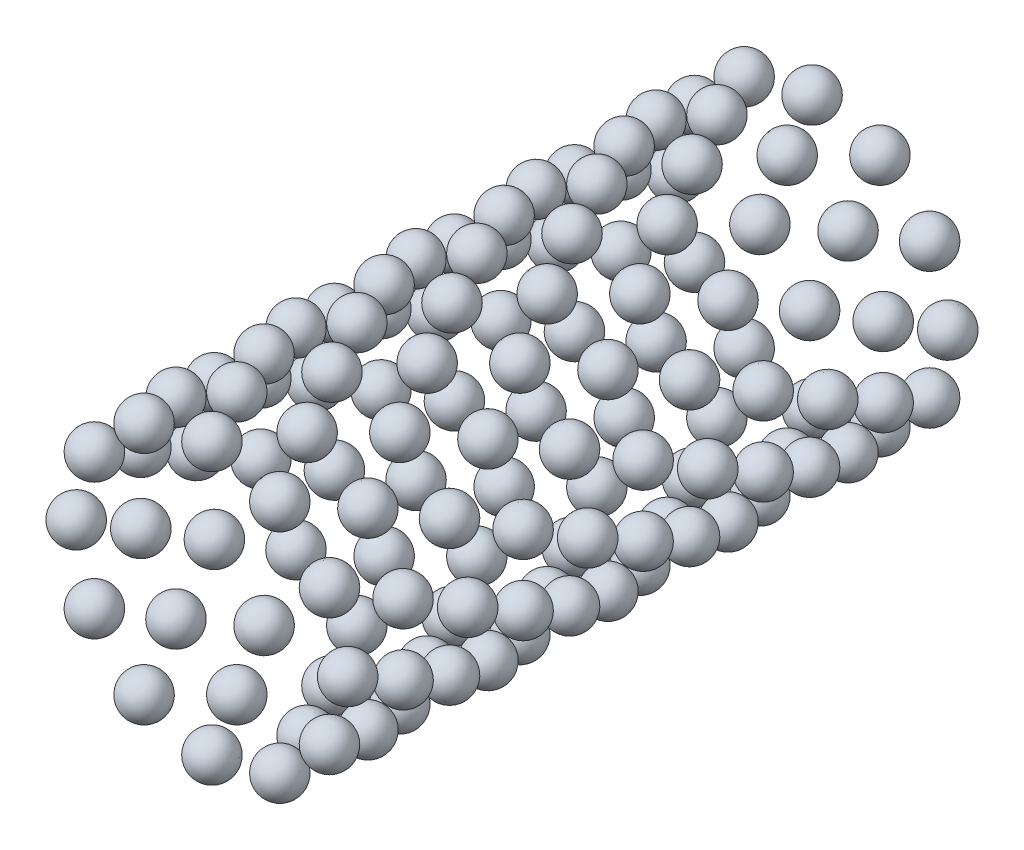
ISO-10303-21;
HEADER;
FILE_DESCRIPTION(('STEP AP214'),'2;1');
FILE_NAME('part.step','',(''),(''),'','','');
FILE_SCHEMA(('AUTOMOTIVE_DESIGN { 1 0 10303 214 1 1 1 1 }'));
ENDSEC;
DATA;
#1=APPLICATION_CONTEXT('core data for automotive mechanical design processes');
#2=APPLICATION_PROTOCOL_DEFINITION('international standard','automotive_design',2000,#1);
#3=PRODUCT_CONTEXT('',#1,'mechanical');
#4=PRODUCT('Part','Part','',(#3));
#5=PRODUCT_RELATED_PRODUCT_CATEGORY('part','',(#4));
#6=PRODUCT_DEFINITION_FORMATION('','',#4);
#7=PRODUCT_DEFINITION_CONTEXT('part definition',#1,'design');
#8=PRODUCT_DEFINITION('design','',#6,#7);
#9=PRODUCT_DEFINITION_SHAPE('','',#8);
#10=(LENGTH_UNIT() NAMED_UNIT(*) SI_UNIT(.MILLI.,.METRE.));
#11=(NAMED_UNIT(*) PLANE_ANGLE_UNIT() SI_UNIT($,.RADIAN.));
#12=(NAMED_UNIT(*) SI_UNIT($,.STERADIAN.) SOLID_ANGLE_UNIT());
#13=UNCERTAINTY_MEASURE_WITH_UNIT(LENGTH_MEASURE(1.E-05),#10,'distance_accuracy_value','');
#14=(GEOMETRIC_REPRESENTATION_CONTEXT(3) GLOBAL_UNCERTAINTY_ASSIGNED_CONTEXT((#13)) GLOBAL_UNIT_ASSIGNED_CONTEXT((#10,
#11,#12)) REPRESENTATION_CONTEXT('',''));
#15=CARTESIAN_POINT('',(0.,0.,0.));
#16=DIRECTION('',(0.,0.,1.));
#17=DIRECTION('',(1.,0.,0.));
#18=AXIS2_PLACEMENT_3D('',#15,#16,#17);
#19=CARTESIAN_POINT('',(-9.17629534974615,-2.45878092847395,-4.2));
#20=DIRECTION('',(-1.,0.,0.));
#21=DIRECTION('',(0.,-1.,0.));
#22=AXIS2_PLACEMENT_3D('',#19,#20,#21);
#23=SPHERICAL_SURFACE('',#22,1.5);
#24=CARTESIAN_POINT('',(-10.6762953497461,-2.45878092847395,-4.2));
#25=VERTEX_POINT('',#24);
#26=VERTEX_LOOP('',#25);
#27=FACE_BOUND('',#26,.T.);
#28=CARTESIAN_POINT('',(-7.67629534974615,-2.45878092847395,-4.2));
#29=VERTEX_POINT('',#28);
#30=VERTEX_LOOP('',#29);
#31=FACE_BOUND('',#30,.T.);
#32=ADVANCED_FACE('P0_F16',(#27,#31),#23,.T.);
#33=CLOSED_SHELL('',(#32));
#34=MANIFOLD_SOLID_BREP('P0_B1',#33);
#35=CARTESIAN_POINT('',(9.17629534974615,2.45878092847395,-4.2));
#36=DIRECTION('',(1.,0.,0.));
#37=DIRECTION('',(0.,1.,0.));
#38=AXIS2_PLACEMENT_3D('',#35,#36,#37);
#39=SPHERICAL_SURFACE('',#38,1.5);
#40=CARTESIAN_POINT('',(10.6762953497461,2.45878092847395,-4.2));
#41=VERTEX_POINT('',#40);
#42=VERTEX_LOOP('',#41);
#43=FACE_BOUND('',#42,.T.);
#44=CARTESIAN_POINT('',(7.67629534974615,2.45878092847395,-4.2));
#45=VERTEX_POINT('',#44);
#46=VERTEX_LOOP('',#45);
#47=FACE_BOUND('',#46,.T.);
#48=ADVANCED_FACE('P1_F16',(#43,#47),#39,.T.);
#49=CLOSED_SHELL('',(#48));
#50=MANIFOLD_SOLID_BREP('P1_B1',#49);
#51=CARTESIAN_POINT('',(9.17629534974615,2.45878092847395,-29.4));
#52=DIRECTION('',(1.,0.,0.));
#53=DIRECTION('',(0.,1.,0.));
#54=AXIS2_PLACEMENT_3D('',#51,#52,#53);
#55=SPHERICAL_SURFACE('',#54,1.5);
#56=CARTESIAN_POINT('',(10.6762953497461,2.45878092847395,-29.4));
#57=VERTEX_POINT('',#56);
#58=VERTEX_LOOP('',#57);
#59=FACE_BOUND('',#58,.T.);
#60=CARTESIAN_POINT('',(7.67629534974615,2.45878092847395,-29.4));
#61=VERTEX_POINT('',#60);
#62=VERTEX_LOOP('',#61);
#63=FACE_BOUND('',#62,.T.);
#64=ADVANCED_FACE('P2_F16',(#59,#63),#55,.T.);
#65=CLOSED_SHELL('',(#64));
#66=MANIFOLD_SOLID_BREP('P2_B1',#65);
#67=CARTESIAN_POINT('',(-6.7175144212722,-6.7175144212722,-29.4));
#68=DIRECTION('',(-0.866025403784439,-0.5,0.));
#69=DIRECTION('',(0.5,-0.866025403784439,0.));
#70=AXIS2_PLACEMENT_3D('',#67,#68,#69);
#71=SPHERICAL_SURFACE('',#70,1.5);
#72=CARTESIAN_POINT('',(-8.01655252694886,-7.4675144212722,-29.4));
#73=VERTEX_POINT('',#72);
#74=VERTEX_LOOP('',#73);
#75=FACE_BOUND('',#74,.T.);
#76=CARTESIAN_POINT('',(-5.41847631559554,-5.9675144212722,-29.4));
#77=VERTEX_POINT('',#76);
#78=VERTEX_LOOP('',#77);
#79=FACE_BOUND('',#78,.T.);
#80=ADVANCED_FACE('P3_F16',(#75,#79),#71,.T.);
#81=CLOSED_SHELL('',(#80));
#82=MANIFOLD_SOLID_BREP('P3_B1',#81);
#83=CARTESIAN_POINT('',(-6.7175144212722,6.7175144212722,-21.));
#84=DIRECTION('',(-0.5,0.866025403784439,0.));
#85=DIRECTION('',(-0.866025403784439,-0.5,0.));
#86=AXIS2_PLACEMENT_3D('',#83,#84,#85);
#87=SPHERICAL_SURFACE('',#86,1.5);
#88=CARTESIAN_POINT('',(-7.4675144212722,8.01655252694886,-21.));
#89=VERTEX_POINT('',#88);
#90=VERTEX_LOOP('',#89);
#91=FACE_BOUND('',#90,.T.);
#92=CARTESIAN_POINT('',(-5.9675144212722,5.41847631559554,-21.));
#93=VERTEX_POINT('',#92);
#94=VERTEX_LOOP('',#93);
#95=FACE_BOUND('',#94,.T.);
#96=ADVANCED_FACE('P4_F16',(#91,#95),#87,.T.);
#97=CLOSED_SHELL('',(#96));
#98=MANIFOLD_SOLID_BREP('P4_B1',#97);
#99=CARTESIAN_POINT('',(2.45878092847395,9.17629534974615,-29.4));
#100=DIRECTION('',(0.5,0.866025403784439,0.));
#101=DIRECTION('',(-0.866025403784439,0.5,0.));
#102=AXIS2_PLACEMENT_3D('',#99,#100,#101);
#103=SPHERICAL_SURFACE('',#102,1.5);
#104=CARTESIAN_POINT('',(3.20878092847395,10.4753334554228,-29.4));
#105=VERTEX_POINT('',#104);
#106=VERTEX_LOOP('',#105);
#107=FACE_BOUND('',#106,.T.);
#108=CARTESIAN_POINT('',(1.70878092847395,7.87725724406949,-29.4));
#109=VERTEX_POINT('',#108);
#110=VERTEX_LOOP('',#109);
#111=FACE_BOUND('',#110,.T.);
#112=ADVANCED_FACE('P5_F16',(#107,#111),#103,.T.);
#113=CLOSED_SHELL('',(#112));
#114=MANIFOLD_SOLID_BREP('P5_B1',#113);
#115=CARTESIAN_POINT('',(-6.7175144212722,-6.7175144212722,-4.2));
#116=DIRECTION('',(-0.866025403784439,-0.5,0.));
#117=DIRECTION('',(0.5,-0.866025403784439,0.));
#118=AXIS2_PLACEMENT_3D('',#115,#116,#117);
#119=SPHERICAL_SURFACE('',#118,1.5);
#120=CARTESIAN_POINT('',(-8.01655252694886,-7.4675144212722,-4.2));
#121=VERTEX_POINT('',#120);
#122=VERTEX_LOOP('',#121);
#123=FACE_BOUND('',#122,.T.);
#124=CARTESIAN_POINT('',(-5.41847631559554,-5.9675144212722,-4.2));
#125=VERTEX_POINT('',#124);
#126=VERTEX_LOOP('',#125);
#127=FACE_BOUND('',#126,.T.);
#128=ADVANCED_FACE('P6_F16',(#123,#127),#119,.T.);
#129=CLOSED_SHELL('',(#128));
#130=MANIFOLD_SOLID_BREP('P6_B1',#129);
#131=CARTESIAN_POINT('',(4.75,8.22724133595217,-25.2));
#132=DIRECTION('',(0.5,0.866025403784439,0.));
#133=DIRECTION('',(-0.866025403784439,0.5,0.));
#134=AXIS2_PLACEMENT_3D('',#131,#132,#133);
#135=SPHERICAL_SURFACE('',#134,1.5);
#136=CARTESIAN_POINT('',(5.5,9.52627944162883,-25.2));
#137=VERTEX_POINT('',#136);
#138=VERTEX_LOOP('',#137);
#139=FACE_BOUND('',#138,.T.);
#140=CARTESIAN_POINT('',(4.,6.92820323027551,-25.2));
#141=VERTEX_POINT('',#140);
#142=VERTEX_LOOP('',#141);
#143=FACE_BOUND('',#142,.T.);
#144=ADVANCED_FACE('P7_F16',(#139,#143),#135,.T.);
#145=CLOSED_SHELL('',(#144));
#146=MANIFOLD_SOLID_BREP('P7_B1',#145);
#147=CARTESIAN_POINT('',(6.7175144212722,-6.71751442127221,-37.8));
#148=DIRECTION('',(0.499999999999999,-0.866025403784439,0.));
#149=DIRECTION('',(0.866025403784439,0.499999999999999,0.));
#150=AXIS2_PLACEMENT_3D('',#147,#148,#149);
#151=SPHERICAL_SURFACE('',#150,1.5);
#152=CARTESIAN_POINT('',(7.4675144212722,-8.01655252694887,-37.8));
#153=VERTEX_POINT('',#152);
#154=VERTEX_LOOP('',#153);
#155=FACE_BOUND('',#154,.T.);
#156=CARTESIAN_POINT('',(5.9675144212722,-5.41847631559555,-37.8));
#157=VERTEX_POINT('',#156);
#158=VERTEX_LOOP('',#157);
#159=FACE_BOUND('',#158,.T.);
#160=ADVANCED_FACE('P8_F16',(#155,#159),#151,.T.);
#161=CLOSED_SHELL('',(#160));
#162=MANIFOLD_SOLID_BREP('P8_B1',#161);
#163=CARTESIAN_POINT('',(2.45878092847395,9.17629534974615,-37.8));
#164=DIRECTION('',(0.5,0.866025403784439,0.));
#165=DIRECTION('',(-0.866025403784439,0.5,0.));
#166=AXIS2_PLACEMENT_3D('',#163,#164,#165);
#167=SPHERICAL_SURFACE('',#166,1.5);
#168=CARTESIAN_POINT('',(3.20878092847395,10.4753334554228,-37.8));
#169=VERTEX_POINT('',#168);
#170=VERTEX_LOOP('',#169);
#171=FACE_BOUND('',#170,.T.);
#172=CARTESIAN_POINT('',(1.70878092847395,7.87725724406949,-37.8));
#173=VERTEX_POINT('',#172);
#174=VERTEX_LOOP('',#173);
#175=FACE_BOUND('',#174,.T.);
#176=ADVANCED_FACE('P9_F16',(#171,#175),#167,.T.);
#177=CLOSED_SHELL('',(#176));
#178=MANIFOLD_SOLID_BREP('P9_B1',#177);
#179=CARTESIAN_POINT('',(9.5,0.,-33.6));
#180=DIRECTION('',(1.,0.,0.));
#181=DIRECTION('',(0.,1.,0.));
#182=AXIS2_PLACEMENT_3D('',#179,#180,#181);
#183=SPHERICAL_SURFACE('',#182,1.5);
#184=CARTESIAN_POINT('',(11.,0.,-33.6));
#185=VERTEX_POINT('',#184);
#186=VERTEX_LOOP('',#185);
#187=FACE_BOUND('',#186,.T.);
#188=CARTESIAN_POINT('',(8.,0.,-33.6));
#189=VERTEX_POINT('',#188);
#190=VERTEX_LOOP('',#189);
#191=FACE_BOUND('',#190,.T.);
#192=ADVANCED_FACE('P10_F16',(#187,#191),#183,.T.);
#193=CLOSED_SHELL('',(#192));
#194=MANIFOLD_SOLID_BREP('P10_B1',#193);
#195=CARTESIAN_POINT('',(4.75,-8.22724133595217,0.));
#196=DIRECTION('',(0.499999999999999,-0.866025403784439,0.));
#197=DIRECTION('',(0.866025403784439,0.499999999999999,0.));
#198=AXIS2_PLACEMENT_3D('',#195,#196,#197);
#199=SPHERICAL_SURFACE('',#198,1.5);
#200=CARTESIAN_POINT('',(5.49999999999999,-9.52627944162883,0.));
#201=VERTEX_POINT('',#200);
#202=VERTEX_LOOP('',#201);
#203=FACE_BOUND('',#202,.T.);
#204=CARTESIAN_POINT('',(4.,-6.92820323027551,0.));
#205=VERTEX_POINT('',#204);
#206=VERTEX_LOOP('',#205);
#207=FACE_BOUND('',#206,.T.);
#208=ADVANCED_FACE('P11_F16',(#203,#207),#199,.T.);
#209=CLOSED_SHELL('',(#208));
#210=MANIFOLD_SOLID_BREP('P11_B1',#209);
#211=CARTESIAN_POINT('',(9.5,0.,-42.));
#212=DIRECTION('',(1.,0.,0.));
#213=DIRECTION('',(0.,1.,0.));
#214=AXIS2_PLACEMENT_3D('',#211,#212,#213);
#215=SPHERICAL_SURFACE('',#214,1.5);
#216=CARTESIAN_POINT('',(11.,0.,-42.));
#217=VERTEX_POINT('',#216);
#218=VERTEX_LOOP('',#217);
#219=FACE_BOUND('',#218,.T.);
#220=CARTESIAN_POINT('',(8.,0.,-42.));
#221=VERTEX_POINT('',#220);
#222=VERTEX_LOOP('',#221);
#223=FACE_BOUND('',#222,.T.);
#224=ADVANCED_FACE('P12_F16',(#219,#223),#215,.T.);
#225=CLOSED_SHELL('',(#224));
#226=MANIFOLD_SOLID_BREP('P12_B1',#225);
#227=CARTESIAN_POINT('',(-9.17629534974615,-2.45878092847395,-21.));
#228=DIRECTION('',(-1.,0.,0.));
#229=DIRECTION('',(0.,-1.,0.));
#230=AXIS2_PLACEMENT_3D('',#227,#228,#229);
#231=SPHERICAL_SURFACE('',#230,1.5);
#232=CARTESIAN_POINT('',(-10.6762953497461,-2.45878092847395,-21.));
#233=VERTEX_POINT('',#232);
#234=VERTEX_LOOP('',#233);
#235=FACE_BOUND('',#234,.T.);
#236=CARTESIAN_POINT('',(-7.67629534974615,-2.45878092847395,-21.));
#237=VERTEX_POINT('',#236);
#238=VERTEX_LOOP('',#237);
#239=FACE_BOUND('',#238,.T.);
#240=ADVANCED_FACE('P13_F16',(#235,#239),#231,.T.);
#241=CLOSED_SHELL('',(#240));
#242=MANIFOLD_SOLID_BREP('P13_B1',#241);
#243=CARTESIAN_POINT('',(-2.45878092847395,9.17629534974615,-29.4));
#244=DIRECTION('',(0.,1.,0.));
#245=DIRECTION('',(-1.,0.,0.));
#246=AXIS2_PLACEMENT_3D('',#243,#244,#245);
#247=SPHERICAL_SURFACE('',#246,1.5);
#248=CARTESIAN_POINT('',(-2.45878092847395,10.6762953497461,-29.4));
#249=VERTEX_POINT('',#248);
#250=VERTEX_LOOP('',#249);
#251=FACE_BOUND('',#250,.T.);
#252=CARTESIAN_POINT('',(-2.45878092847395,7.67629534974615,-29.4));
#253=VERTEX_POINT('',#252);
#254=VERTEX_LOOP('',#253);
#255=FACE_BOUND('',#254,.T.);
#256=ADVANCED_FACE('P14_F16',(#251,#255),#247,.T.);
#257=CLOSED_SHELL('',(#256));
#258=MANIFOLD_SOLID_BREP('P14_B1',#257);
#259=CARTESIAN_POINT('',(-9.17629534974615,-2.45878092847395,-29.4));
#260=DIRECTION('',(-1.,0.,0.));
#261=DIRECTION('',(0.,-1.,0.));
#262=AXIS2_PLACEMENT_3D('',#259,#260,#261);
#263=SPHERICAL_SURFACE('',#262,1.5);
#264=CARTESIAN_POINT('',(-10.6762953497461,-2.45878092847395,-29.4));
#265=VERTEX_POINT('',#264);
#266=VERTEX_LOOP('',#265);
#267=FACE_BOUND('',#266,.T.);
#268=CARTESIAN_POINT('',(-7.67629534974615,-2.45878092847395,-29.4));
#269=VERTEX_POINT('',#268);
#270=VERTEX_LOOP('',#269);
#271=FACE_BOUND('',#270,.T.);
#272=ADVANCED_FACE('P15_F16',(#267,#271),#263,.T.);
#273=CLOSED_SHELL('',(#272));
#274=MANIFOLD_SOLID_BREP('P15_B1',#273);
#275=CARTESIAN_POINT('',(9.5,0.,-25.2));
#276=DIRECTION('',(1.,0.,0.));
#277=DIRECTION('',(0.,1.,0.));
#278=AXIS2_PLACEMENT_3D('',#275,#276,#277);
#279=SPHERICAL_SURFACE('',#278,1.5);
#280=CARTESIAN_POINT('',(11.,0.,-25.2));
#281=VERTEX_POINT('',#280);
#282=VERTEX_LOOP('',#281);
#283=FACE_BOUND('',#282,.T.);
#284=CARTESIAN_POINT('',(8.,0.,-25.2));
#285=VERTEX_POINT('',#284);
#286=VERTEX_LOOP('',#285);
#287=FACE_BOUND('',#286,.T.);
#288=ADVANCED_FACE('P16_F16',(#283,#287),#279,.T.);
#289=CLOSED_SHELL('',(#288));
#290=MANIFOLD_SOLID_BREP('P16_B1',#289);
#291=CARTESIAN_POINT('',(4.75,8.22724133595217,-16.8));
#292=DIRECTION('',(0.5,0.866025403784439,0.));
#293=DIRECTION('',(-0.866025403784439,0.5,0.));
#294=AXIS2_PLACEMENT_3D('',#291,#292,#293);
#295=SPHERICAL_SURFACE('',#294,1.5);
#296=CARTESIAN_POINT('',(5.5,9.52627944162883,-16.8));
#297=VERTEX_POINT('',#296);
#298=VERTEX_LOOP('',#297);
#299=FACE_BOUND('',#298,.T.);
#300=CARTESIAN_POINT('',(4.,6.92820323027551,-16.8));
#301=VERTEX_POINT('',#300);
#302=VERTEX_LOOP('',#301);
#303=FACE_BOUND('',#302,.T.);
#304=ADVANCED_FACE('P17_F16',(#299,#303),#295,.T.);
#305=CLOSED_SHELL('',(#304));
#306=MANIFOLD_SOLID_BREP('P17_B1',#305);
#307=CARTESIAN_POINT('',(8.22724133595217,4.75,-25.2));
#308=DIRECTION('',(0.866025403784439,0.5,0.));
#309=DIRECTION('',(-0.5,0.866025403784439,0.));
#310=AXIS2_PLACEMENT_3D('',#307,#308,#309);
#311=SPHERICAL_SURFACE('',#310,1.5);
#312=CARTESIAN_POINT('',(9.52627944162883,5.5,-25.2));
#313=VERTEX_POINT('',#312);
#314=VERTEX_LOOP('',#313);
#315=FACE_BOUND('',#314,.T.);
#316=CARTESIAN_POINT('',(6.92820323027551,4.,-25.2));
#317=VERTEX_POINT('',#316);
#318=VERTEX_LOOP('',#317);
#319=FACE_BOUND('',#318,.T.);
#320=ADVANCED_FACE('P18_F16',(#315,#319),#311,.T.);
#321=CLOSED_SHELL('',(#320));
#322=MANIFOLD_SOLID_BREP('P18_B1',#321);
#323=CARTESIAN_POINT('',(2.45878092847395,-9.17629534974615,-29.4));
#324=DIRECTION('',(0.,-1.,0.));
#325=DIRECTION('',(1.,0.,0.));
#326=AXIS2_PLACEMENT_3D('',#323,#324,#325);
#327=SPHERICAL_SURFACE('',#326,1.5);
#328=CARTESIAN_POINT('',(2.45878092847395,-10.6762953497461,-29.4));
#329=VERTEX_POINT('',#328);
#330=VERTEX_LOOP('',#329);
#331=FACE_BOUND('',#330,.T.);
#332=CARTESIAN_POINT('',(2.45878092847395,-7.67629534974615,-29.4));
#333=VERTEX_POINT('',#332);
#334=VERTEX_LOOP('',#333);
#335=FACE_BOUND('',#334,.T.);
#336=ADVANCED_FACE('P19_F16',(#331,#335),#327,.T.);
#337=CLOSED_SHELL('',(#336));
#338=MANIFOLD_SOLID_BREP('P19_B1',#337);
#339=CARTESIAN_POINT('',(9.17629534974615,-2.45878092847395,-21.));
#340=DIRECTION('',(0.866025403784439,-0.5,0.));
#341=DIRECTION('',(0.5,0.866025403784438,0.));
#342=AXIS2_PLACEMENT_3D('',#339,#340,#341);
#343=SPHERICAL_SURFACE('',#342,1.5);
#344=CARTESIAN_POINT('',(10.4753334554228,-3.20878092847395,-21.));
#345=VERTEX_POINT('',#344);
#346=VERTEX_LOOP('',#345);
#347=FACE_BOUND('',#346,.T.);
#348=CARTESIAN_POINT('',(7.87725724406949,-1.70878092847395,-21.));
#349=VERTEX_POINT('',#348);
#350=VERTEX_LOOP('',#349);
#351=FACE_BOUND('',#350,.T.);
#352=ADVANCED_FACE('P20_F16',(#347,#351),#343,.T.);
#353=CLOSED_SHELL('',(#352));
#354=MANIFOLD_SOLID_BREP('P20_B1',#353);
#355=CARTESIAN_POINT('',(0.,-9.5,-8.4));
#356=DIRECTION('',(0.,-1.,0.));
#357=DIRECTION('',(1.,0.,0.));
#358=AXIS2_PLACEMENT_3D('',#355,#356,#357);
#359=SPHERICAL_SURFACE('',#358,1.5);
#360=CARTESIAN_POINT('',(0.,-11.,-8.4));
#361=VERTEX_POINT('',#360);
#362=VERTEX_LOOP('',#361);
#363=FACE_BOUND('',#362,.T.);
#364=CARTESIAN_POINT('',(0.,-8.,-8.4));
#365=VERTEX_POINT('',#364);
#366=VERTEX_LOOP('',#365);
#367=FACE_BOUND('',#366,.T.);
#368=ADVANCED_FACE('P21_F16',(#363,#367),#359,.T.);
#369=CLOSED_SHELL('',(#368));
#370=MANIFOLD_SOLID_BREP('P21_B1',#369);
#371=CARTESIAN_POINT('',(4.75,-8.22724133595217,-33.6));
#372=DIRECTION('',(0.499999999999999,-0.866025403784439,0.));
#373=DIRECTION('',(0.866025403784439,0.499999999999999,0.));
#374=AXIS2_PLACEMENT_3D('',#371,#372,#373);
#375=SPHERICAL_SURFACE('',#374,1.5);
#376=CARTESIAN_POINT('',(5.49999999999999,-9.52627944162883,-33.6));
#377=VERTEX_POINT('',#376);
#378=VERTEX_LOOP('',#377);
#379=FACE_BOUND('',#378,.T.);
#380=CARTESIAN_POINT('',(4.,-6.92820323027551,-33.6));
#381=VERTEX_POINT('',#380);
#382=VERTEX_LOOP('',#381);
#383=FACE_BOUND('',#382,.T.);
#384=ADVANCED_FACE('P22_F16',(#379,#383),#375,.T.);
#385=CLOSED_SHELL('',(#384));
#386=MANIFOLD_SOLID_BREP('P22_B1',#385);
#387=CARTESIAN_POINT('',(8.22724133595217,4.75,-33.6));
#388=DIRECTION('',(0.866025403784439,0.5,0.));
#389=DIRECTION('',(-0.5,0.866025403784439,0.));
#390=AXIS2_PLACEMENT_3D('',#387,#388,#389);
#391=SPHERICAL_SURFACE('',#390,1.5);
#392=CARTESIAN_POINT('',(9.52627944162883,5.5,-33.6));
#393=VERTEX_POINT('',#392);
#394=VERTEX_LOOP('',#393);
#395=FACE_BOUND('',#394,.T.);
#396=CARTESIAN_POINT('',(6.92820323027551,4.,-33.6));
#397=VERTEX_POINT('',#396);
#398=VERTEX_LOOP('',#397);
#399=FACE_BOUND('',#398,.T.);
#400=ADVANCED_FACE('P23_F16',(#395,#399),#391,.T.);
#401=CLOSED_SHELL('',(#400));
#402=MANIFOLD_SOLID_BREP('P23_B1',#401);
#403=CARTESIAN_POINT('',(6.7175144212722,-6.71751442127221,-12.6));
#404=DIRECTION('',(0.499999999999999,-0.866025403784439,0.));
#405=DIRECTION('',(0.866025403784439,0.499999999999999,0.));
#406=AXIS2_PLACEMENT_3D('',#403,#404,#405);
#407=SPHERICAL_SURFACE('',#406,1.5);
#408=CARTESIAN_POINT('',(7.4675144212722,-8.01655252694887,-12.6));
#409=VERTEX_POINT('',#408);
#410=VERTEX_LOOP('',#409);
#411=FACE_BOUND('',#410,.T.);
#412=CARTESIAN_POINT('',(5.9675144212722,-5.41847631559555,-12.6));
#413=VERTEX_POINT('',#412);
#414=VERTEX_LOOP('',#413);
#415=FACE_BOUND('',#414,.T.);
#416=ADVANCED_FACE('P24_F16',(#411,#415),#407,.T.);
#417=CLOSED_SHELL('',(#416));
#418=MANIFOLD_SOLID_BREP('P24_B1',#417);
#419=CARTESIAN_POINT('',(4.75,-8.22724133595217,-25.2));
#420=DIRECTION('',(0.499999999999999,-0.866025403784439,0.));
#421=DIRECTION('',(0.866025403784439,0.499999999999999,0.));
#422=AXIS2_PLACEMENT_3D('',#419,#420,#421);
#423=SPHERICAL_SURFACE('',#422,1.5);
#424=CARTESIAN_POINT('',(5.49999999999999,-9.52627944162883,-25.2));
#425=VERTEX_POINT('',#424);
#426=VERTEX_LOOP('',#425);
#427=FACE_BOUND('',#426,.T.);
#428=CARTESIAN_POINT('',(4.,-6.92820323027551,-25.2));
#429=VERTEX_POINT('',#428);
#430=VERTEX_LOOP('',#429);
#431=FACE_BOUND('',#430,.T.);
#432=ADVANCED_FACE('P25_F16',(#427,#431),#423,.T.);
#433=CLOSED_SHELL('',(#432));
#434=MANIFOLD_SOLID_BREP('P25_B1',#433);
#435=CARTESIAN_POINT('',(-4.75,-8.22724133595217,-42.));
#436=DIRECTION('',(-0.5,-0.866025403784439,0.));
#437=DIRECTION('',(0.866025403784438,-0.5,0.));
#438=AXIS2_PLACEMENT_3D('',#435,#436,#437);
#439=SPHERICAL_SURFACE('',#438,1.5);
#440=CARTESIAN_POINT('',(-5.5,-9.52627944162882,-42.));
#441=VERTEX_POINT('',#440);
#442=VERTEX_LOOP('',#441);
#443=FACE_BOUND('',#442,.T.);
#444=CARTESIAN_POINT('',(-4.,-6.92820323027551,-42.));
#445=VERTEX_POINT('',#444);
#446=VERTEX_LOOP('',#445);
#447=FACE_BOUND('',#446,.T.);
#448=ADVANCED_FACE('P26_F16',(#443,#447),#439,.T.);
#449=CLOSED_SHELL('',(#448));
#450=MANIFOLD_SOLID_BREP('P26_B1',#449);
#451=CARTESIAN_POINT('',(-8.22724133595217,-4.75,-16.8));
#452=DIRECTION('',(-0.866025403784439,-0.5,0.));
#453=DIRECTION('',(0.5,-0.866025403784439,0.));
#454=AXIS2_PLACEMENT_3D('',#451,#452,#453);
#455=SPHERICAL_SURFACE('',#454,1.5);
#456=CARTESIAN_POINT('',(-9.52627944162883,-5.5,-16.8));
#457=VERTEX_POINT('',#456);
#458=VERTEX_LOOP('',#457);
#459=FACE_BOUND('',#458,.T.);
#460=CARTESIAN_POINT('',(-6.92820323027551,-4.,-16.8));
#461=VERTEX_POINT('',#460);
#462=VERTEX_LOOP('',#461);
#463=FACE_BOUND('',#462,.T.);
#464=ADVANCED_FACE('P27_F16',(#459,#463),#455,.T.);
#465=CLOSED_SHELL('',(#464));
#466=MANIFOLD_SOLID_BREP('P27_B1',#465);
#467=CARTESIAN_POINT('',(6.7175144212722,-6.71751442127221,-21.));
#468=DIRECTION('',(0.499999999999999,-0.866025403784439,0.));
#469=DIRECTION('',(0.866025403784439,0.499999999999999,0.));
#470=AXIS2_PLACEMENT_3D('',#467,#468,#469);
#471=SPHERICAL_SURFACE('',#470,1.5);
#472=CARTESIAN_POINT('',(7.4675144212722,-8.01655252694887,-21.));
#473=VERTEX_POINT('',#472);
#474=VERTEX_LOOP('',#473);
#475=FACE_BOUND('',#474,.T.);
#476=CARTESIAN_POINT('',(5.9675144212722,-5.41847631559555,-21.));
#477=VERTEX_POINT('',#476);
#478=VERTEX_LOOP('',#477);
#479=FACE_BOUND('',#478,.T.);
#480=ADVANCED_FACE('P28_F16',(#475,#479),#471,.T.);
#481=CLOSED_SHELL('',(#480));
#482=MANIFOLD_SOLID_BREP('P28_B1',#481);
#483=CARTESIAN_POINT('',(-2.45878092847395,9.17629534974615,-4.2));
#484=DIRECTION('',(0.,1.,0.));
#485=DIRECTION('',(-1.,0.,0.));
#486=AXIS2_PLACEMENT_3D('',#483,#484,#485);
#487=SPHERICAL_SURFACE('',#486,1.5);
#488=CARTESIAN_POINT('',(-2.45878092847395,10.6762953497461,-4.2));
#489=VERTEX_POINT('',#488);
#490=VERTEX_LOOP('',#489);
#491=FACE_BOUND('',#490,.T.);
#492=CARTESIAN_POINT('',(-2.45878092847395,7.67629534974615,-4.2));
#493=VERTEX_POINT('',#492);
#494=VERTEX_LOOP('',#493);
#495=FACE_BOUND('',#494,.T.);
#496=ADVANCED_FACE('P29_F16',(#491,#495),#487,.T.);
#497=CLOSED_SHELL('',(#496));
#498=MANIFOLD_SOLID_BREP('P29_B1',#497);
#499=CARTESIAN_POINT('',(-2.45878092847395,9.17629534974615,-12.6));
#500=DIRECTION('',(0.,1.,0.));
#501=DIRECTION('',(-1.,0.,0.));
#502=AXIS2_PLACEMENT_3D('',#499,#500,#501);
#503=SPHERICAL_SURFACE('',#502,1.5);
#504=CARTESIAN_POINT('',(-2.45878092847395,10.6762953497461,-12.6));
#505=VERTEX_POINT('',#504);
#506=VERTEX_LOOP('',#505);
#507=FACE_BOUND('',#506,.T.);
#508=CARTESIAN_POINT('',(-2.45878092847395,7.67629534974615,-12.6));
#509=VERTEX_POINT('',#508);
#510=VERTEX_LOOP('',#509);
#511=FACE_BOUND('',#510,.T.);
#512=ADVANCED_FACE('P30_F16',(#507,#511),#503,.T.);
#513=CLOSED_SHELL('',(#512));
#514=MANIFOLD_SOLID_BREP('P30_B1',#513);
#515=CARTESIAN_POINT('',(-9.17629534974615,2.45878092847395,-29.4));
#516=DIRECTION('',(-0.866025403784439,0.5,0.));
#517=DIRECTION('',(-0.5,-0.866025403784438,0.));
#518=AXIS2_PLACEMENT_3D('',#515,#516,#517);
#519=SPHERICAL_SURFACE('',#518,1.5);
#520=CARTESIAN_POINT('',(-10.4753334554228,3.20878092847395,-29.4));
#521=VERTEX_POINT('',#520);
#522=VERTEX_LOOP('',#521);
#523=FACE_BOUND('',#522,.T.);
#524=CARTESIAN_POINT('',(-7.87725724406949,1.70878092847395,-29.4));
#525=VERTEX_POINT('',#524);
#526=VERTEX_LOOP('',#525);
#527=FACE_BOUND('',#526,.T.);
#528=ADVANCED_FACE('P31_F16',(#523,#527),#519,.T.);
#529=CLOSED_SHELL('',(#528));
#530=MANIFOLD_SOLID_BREP('P31_B1',#529);
#531=CARTESIAN_POINT('',(-4.75,-8.22724133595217,-8.4));
#532=DIRECTION('',(-0.5,-0.866025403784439,0.));
#533=DIRECTION('',(0.866025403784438,-0.5,0.));
#534=AXIS2_PLACEMENT_3D('',#531,#532,#533);
#535=SPHERICAL_SURFACE('',#534,1.5);
#536=CARTESIAN_POINT('',(-5.5,-9.52627944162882,-8.4));
#537=VERTEX_POINT('',#536);
#538=VERTEX_LOOP('',#537);
#539=FACE_BOUND('',#538,.T.);
#540=CARTESIAN_POINT('',(-4.,-6.92820323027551,-8.4));
#541=VERTEX_POINT('',#540);
#542=VERTEX_LOOP('',#541);
#543=FACE_BOUND('',#542,.T.);
#544=ADVANCED_FACE('P32_F16',(#539,#543),#535,.T.);
#545=CLOSED_SHELL('',(#544));
#546=MANIFOLD_SOLID_BREP('P32_B1',#545);
#547=CARTESIAN_POINT('',(9.17629534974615,-2.45878092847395,-37.8));
#548=DIRECTION('',(0.866025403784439,-0.5,0.));
#549=DIRECTION('',(0.5,0.866025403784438,0.));
#550=AXIS2_PLACEMENT_3D('',#547,#548,#549);
#551=SPHERICAL_SURFACE('',#550,1.5);
#552=CARTESIAN_POINT('',(10.4753334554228,-3.20878092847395,-37.8));
#553=VERTEX_POINT('',#552);
#554=VERTEX_LOOP('',#553);
#555=FACE_BOUND('',#554,.T.);
#556=CARTESIAN_POINT('',(7.87725724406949,-1.70878092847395,-37.8));
#557=VERTEX_POINT('',#556);
#558=VERTEX_LOOP('',#557);
#559=FACE_BOUND('',#558,.T.);
#560=ADVANCED_FACE('P33_F16',(#555,#559),#551,.T.);
#561=CLOSED_SHELL('',(#560));
#562=MANIFOLD_SOLID_BREP('P33_B1',#561);
#563=CARTESIAN_POINT('',(0.,-9.5,-33.6));
#564=DIRECTION('',(0.,-1.,0.));
#565=DIRECTION('',(1.,0.,0.));
#566=AXIS2_PLACEMENT_3D('',#563,#564,#565);
#567=SPHERICAL_SURFACE('',#566,1.5);
#568=CARTESIAN_POINT('',(0.,-11.,-33.6));
#569=VERTEX_POINT('',#568);
#570=VERTEX_LOOP('',#569);
#571=FACE_BOUND('',#570,.T.);
#572=CARTESIAN_POINT('',(0.,-8.,-33.6));
#573=VERTEX_POINT('',#572);
#574=VERTEX_LOOP('',#573);
#575=FACE_BOUND('',#574,.T.);
#576=ADVANCED_FACE('P34_F16',(#571,#575),#567,.T.);
#577=CLOSED_SHELL('',(#576));
#578=MANIFOLD_SOLID_BREP('P34_B1',#577);
#579=CARTESIAN_POINT('',(-9.17629534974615,-2.45878092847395,-12.6));
#580=DIRECTION('',(-1.,0.,0.));
#581=DIRECTION('',(0.,-1.,0.));
#582=AXIS2_PLACEMENT_3D('',#579,#580,#581);
#583=SPHERICAL_SURFACE('',#582,1.5);
#584=CARTESIAN_POINT('',(-10.6762953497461,-2.45878092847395,-12.6));
#585=VERTEX_POINT('',#584);
#586=VERTEX_LOOP('',#585);
#587=FACE_BOUND('',#586,.T.);
#588=CARTESIAN_POINT('',(-7.67629534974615,-2.45878092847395,-12.6));
#589=VERTEX_POINT('',#588);
#590=VERTEX_LOOP('',#589);
#591=FACE_BOUND('',#590,.T.);
#592=ADVANCED_FACE('P35_F16',(#587,#591),#583,.T.);
#593=CLOSED_SHELL('',(#592));
#594=MANIFOLD_SOLID_BREP('P35_B1',#593);
#595=CARTESIAN_POINT('',(-4.75,-8.22724133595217,-25.2));
#596=DIRECTION('',(-0.5,-0.866025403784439,0.));
#597=DIRECTION('',(0.866025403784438,-0.5,0.));
#598=AXIS2_PLACEMENT_3D('',#595,#596,#597);
#599=SPHERICAL_SURFACE('',#598,1.5);
#600=CARTESIAN_POINT('',(-5.5,-9.52627944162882,-25.2));
#601=VERTEX_POINT('',#600);
#602=VERTEX_LOOP('',#601);
#603=FACE_BOUND('',#602,.T.);
#604=CARTESIAN_POINT('',(-4.,-6.92820323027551,-25.2));
#605=VERTEX_POINT('',#604);
#606=VERTEX_LOOP('',#605);
#607=FACE_BOUND('',#606,.T.);
#608=ADVANCED_FACE('P36_F16',(#603,#607),#599,.T.);
#609=CLOSED_SHELL('',(#608));
#610=MANIFOLD_SOLID_BREP('P36_B1',#609);
#611=CARTESIAN_POINT('',(-4.75,8.22724133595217,-42.));
#612=DIRECTION('',(-0.5,0.866025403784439,0.));
#613=DIRECTION('',(-0.866025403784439,-0.5,0.));
#614=AXIS2_PLACEMENT_3D('',#611,#612,#613);
#615=SPHERICAL_SURFACE('',#614,1.5);
#616=CARTESIAN_POINT('',(-5.5,9.52627944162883,-42.));
#617=VERTEX_POINT('',#616);
#618=VERTEX_LOOP('',#617);
#619=FACE_BOUND('',#618,.T.);
#620=CARTESIAN_POINT('',(-4.,6.92820323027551,-42.));
#621=VERTEX_POINT('',#620);
#622=VERTEX_LOOP('',#621);
#623=FACE_BOUND('',#622,.T.);
#624=ADVANCED_FACE('P37_F16',(#619,#623),#615,.T.);
#625=CLOSED_SHELL('',(#624));
#626=MANIFOLD_SOLID_BREP('P37_B1',#625);
#627=CARTESIAN_POINT('',(-8.22724133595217,-4.75,-33.6));
#628=DIRECTION('',(-0.866025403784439,-0.5,0.));
#629=DIRECTION('',(0.5,-0.866025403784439,0.));
#630=AXIS2_PLACEMENT_3D('',#627,#628,#629);
#631=SPHERICAL_SURFACE('',#630,1.5);
#632=CARTESIAN_POINT('',(-9.52627944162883,-5.5,-33.6));
#633=VERTEX_POINT('',#632);
#634=VERTEX_LOOP('',#633);
#635=FACE_BOUND('',#634,.T.);
#636=CARTESIAN_POINT('',(-6.92820323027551,-4.,-33.6));
#637=VERTEX_POINT('',#636);
#638=VERTEX_LOOP('',#637);
#639=FACE_BOUND('',#638,.T.);
#640=ADVANCED_FACE('P38_F16',(#635,#639),#631,.T.);
#641=CLOSED_SHELL('',(#640));
#642=MANIFOLD_SOLID_BREP('P38_B1',#641);
#643=CARTESIAN_POINT('',(6.7175144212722,-6.71751442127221,-29.4));
#644=DIRECTION('',(0.499999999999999,-0.866025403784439,0.));
#645=DIRECTION('',(0.866025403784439,0.499999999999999,0.));
#646=AXIS2_PLACEMENT_3D('',#643,#644,#645);
#647=SPHERICAL_SURFACE('',#646,1.5);
#648=CARTESIAN_POINT('',(7.4675144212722,-8.01655252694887,-29.4));
#649=VERTEX_POINT('',#648);
#650=VERTEX_LOOP('',#649);
#651=FACE_BOUND('',#650,.T.);
#652=CARTESIAN_POINT('',(5.9675144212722,-5.41847631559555,-29.4));
#653=VERTEX_POINT('',#652);
#654=VERTEX_LOOP('',#653);
#655=FACE_BOUND('',#654,.T.);
#656=ADVANCED_FACE('P39_F16',(#651,#655),#647,.T.);
#657=CLOSED_SHELL('',(#656));
#658=MANIFOLD_SOLID_BREP('P39_B1',#657);
#659=CARTESIAN_POINT('',(2.45878092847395,9.17629534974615,-4.2));
#660=DIRECTION('',(0.5,0.866025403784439,0.));
#661=DIRECTION('',(-0.866025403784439,0.5,0.));
#662=AXIS2_PLACEMENT_3D('',#659,#660,#661);
#663=SPHERICAL_SURFACE('',#662,1.5);
#664=CARTESIAN_POINT('',(3.20878092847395,10.4753334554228,-4.2));
#665=VERTEX_POINT('',#664);
#666=VERTEX_LOOP('',#665);
#667=FACE_BOUND('',#666,.T.);
#668=CARTESIAN_POINT('',(1.70878092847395,7.87725724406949,-4.2));
#669=VERTEX_POINT('',#668);
#670=VERTEX_LOOP('',#669);
#671=FACE_BOUND('',#670,.T.);
#672=ADVANCED_FACE('P40_F16',(#667,#671),#663,.T.);
#673=CLOSED_SHELL('',(#672));
#674=MANIFOLD_SOLID_BREP('P40_B1',#673);
#675=CARTESIAN_POINT('',(-6.7175144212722,6.7175144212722,-12.6));
#676=DIRECTION('',(-0.5,0.866025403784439,0.));
#677=DIRECTION('',(-0.866025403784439,-0.5,0.));
#678=AXIS2_PLACEMENT_3D('',#675,#676,#677);
#679=SPHERICAL_SURFACE('',#678,1.5);
#680=CARTESIAN_POINT('',(-7.4675144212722,8.01655252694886,-12.6));
#681=VERTEX_POINT('',#680);
#682=VERTEX_LOOP('',#681);
#683=FACE_BOUND('',#682,.T.);
#684=CARTESIAN_POINT('',(-5.9675144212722,5.41847631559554,-12.6));
#685=VERTEX_POINT('',#684);
#686=VERTEX_LOOP('',#685);
#687=FACE_BOUND('',#686,.T.);
#688=ADVANCED_FACE('P41_F16',(#683,#687),#679,.T.);
#689=CLOSED_SHELL('',(#688));
#690=MANIFOLD_SOLID_BREP('P41_B1',#689);
#691=CARTESIAN_POINT('',(6.7175144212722,6.7175144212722,-29.4));
#692=DIRECTION('',(0.866025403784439,0.5,0.));
#693=DIRECTION('',(-0.5,0.866025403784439,0.));
#694=AXIS2_PLACEMENT_3D('',#691,#692,#693);
#695=SPHERICAL_SURFACE('',#694,1.5);
#696=CARTESIAN_POINT('',(8.01655252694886,7.46751442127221,-29.4));
#697=VERTEX_POINT('',#696);
#698=VERTEX_LOOP('',#697);
#699=FACE_BOUND('',#698,.T.);
#700=CARTESIAN_POINT('',(5.41847631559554,5.96751442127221,-29.4));
#701=VERTEX_POINT('',#700);
#702=VERTEX_LOOP('',#701);
#703=FACE_BOUND('',#702,.T.);
#704=ADVANCED_FACE('P42_F16',(#699,#703),#695,.T.);
#705=CLOSED_SHELL('',(#704));
#706=MANIFOLD_SOLID_BREP('P42_B1',#705);
#707=CARTESIAN_POINT('',(8.22724133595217,-4.75,-25.2));
#708=DIRECTION('',(0.866025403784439,-0.5,0.));
#709=DIRECTION('',(0.5,0.866025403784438,0.));
#710=AXIS2_PLACEMENT_3D('',#707,#708,#709);
#711=SPHERICAL_SURFACE('',#710,1.5);
#712=CARTESIAN_POINT('',(9.52627944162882,-5.5,-25.2));
#713=VERTEX_POINT('',#712);
#714=VERTEX_LOOP('',#713);
#715=FACE_BOUND('',#714,.T.);
#716=CARTESIAN_POINT('',(6.92820323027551,-4.,-25.2));
#717=VERTEX_POINT('',#716);
#718=VERTEX_LOOP('',#717);
#719=FACE_BOUND('',#718,.T.);
#720=ADVANCED_FACE('P43_F16',(#715,#719),#711,.T.);
#721=CLOSED_SHELL('',(#720));
#722=MANIFOLD_SOLID_BREP('P43_B1',#721);
#723=CARTESIAN_POINT('',(8.22724133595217,-4.75,-42.));
#724=DIRECTION('',(0.866025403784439,-0.5,0.));
#725=DIRECTION('',(0.5,0.866025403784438,0.));
#726=AXIS2_PLACEMENT_3D('',#723,#724,#725);
#727=SPHERICAL_SURFACE('',#726,1.5);
#728=CARTESIAN_POINT('',(9.52627944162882,-5.5,-42.));
#729=VERTEX_POINT('',#728);
#730=VERTEX_LOOP('',#729);
#731=FACE_BOUND('',#730,.T.);
#732=CARTESIAN_POINT('',(6.92820323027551,-4.,-42.));
#733=VERTEX_POINT('',#732);
#734=VERTEX_LOOP('',#733);
#735=FACE_BOUND('',#734,.T.);
#736=ADVANCED_FACE('P44_F16',(#731,#735),#727,.T.);
#737=CLOSED_SHELL('',(#736));
#738=MANIFOLD_SOLID_BREP('P44_B1',#737);
#739=CARTESIAN_POINT('',(-2.45878092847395,-9.17629534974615,-37.8));
#740=DIRECTION('',(-0.5,-0.866025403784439,0.));
#741=DIRECTION('',(0.866025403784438,-0.5,0.));
#742=AXIS2_PLACEMENT_3D('',#739,#740,#741);
#743=SPHERICAL_SURFACE('',#742,1.5);
#744=CARTESIAN_POINT('',(-3.20878092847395,-10.4753334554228,-37.8));
#745=VERTEX_POINT('',#744);
#746=VERTEX_LOOP('',#745);
#747=FACE_BOUND('',#746,.T.);
#748=CARTESIAN_POINT('',(-1.70878092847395,-7.87725724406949,-37.8));
#749=VERTEX_POINT('',#748);
#750=VERTEX_LOOP('',#749);
#751=FACE_BOUND('',#750,.T.);
#752=ADVANCED_FACE('P45_F16',(#747,#751),#743,.T.);
#753=CLOSED_SHELL('',(#752));
#754=MANIFOLD_SOLID_BREP('P45_B1',#753);
#755=CARTESIAN_POINT('',(-9.5,0.,-8.4));
#756=DIRECTION('',(-1.,0.,0.));
#757=DIRECTION('',(0.,-1.,0.));
#758=AXIS2_PLACEMENT_3D('',#755,#756,#757);
#759=SPHERICAL_SURFACE('',#758,1.5);
#760=CARTESIAN_POINT('',(-11.,0.,-8.4));
#761=VERTEX_POINT('',#760);
#762=VERTEX_LOOP('',#761);
#763=FACE_BOUND('',#762,.T.);
#764=CARTESIAN_POINT('',(-8.,0.,-8.4));
#765=VERTEX_POINT('',#764);
#766=VERTEX_LOOP('',#765);
#767=FACE_BOUND('',#766,.T.);
#768=ADVANCED_FACE('P46_F16',(#763,#767),#759,.T.);
#769=CLOSED_SHELL('',(#768));
#770=MANIFOLD_SOLID_BREP('P46_B1',#769);
#771=CARTESIAN_POINT('',(-4.75,-8.22724133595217,-33.6));
#772=DIRECTION('',(-0.5,-0.866025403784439,0.));
#773=DIRECTION('',(0.866025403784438,-0.5,0.));
#774=AXIS2_PLACEMENT_3D('',#771,#772,#773);
#775=SPHERICAL_SURFACE('',#774,1.5);
#776=CARTESIAN_POINT('',(-5.5,-9.52627944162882,-33.6));
#777=VERTEX_POINT('',#776);
#778=VERTEX_LOOP('',#777);
#779=FACE_BOUND('',#778,.T.);
#780=CARTESIAN_POINT('',(-4.,-6.92820323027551,-33.6));
#781=VERTEX_POINT('',#780);
#782=VERTEX_LOOP('',#781);
#783=FACE_BOUND('',#782,.T.);
#784=ADVANCED_FACE('P47_F16',(#779,#783),#775,.T.);
#785=CLOSED_SHELL('',(#784));
#786=MANIFOLD_SOLID_BREP('P47_B1',#785);
#787=CARTESIAN_POINT('',(2.45878092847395,-9.17629534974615,-12.6));
#788=DIRECTION('',(0.,-1.,0.));
#789=DIRECTION('',(1.,0.,0.));
#790=AXIS2_PLACEMENT_3D('',#787,#788,#789);
#791=SPHERICAL_SURFACE('',#790,1.5);
#792=CARTESIAN_POINT('',(2.45878092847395,-10.6762953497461,-12.6));
#793=VERTEX_POINT('',#792);
#794=VERTEX_LOOP('',#793);
#795=FACE_BOUND('',#794,.T.);
#796=CARTESIAN_POINT('',(2.45878092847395,-7.67629534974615,-12.6));
#797=VERTEX_POINT('',#796);
#798=VERTEX_LOOP('',#797);
#799=FACE_BOUND('',#798,.T.);
#800=ADVANCED_FACE('P48_F16',(#795,#799),#791,.T.);
#801=CLOSED_SHELL('',(#800));
#802=MANIFOLD_SOLID_BREP('P48_B1',#801);
#803=CARTESIAN_POINT('',(4.75,8.22724133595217,0.));
#804=DIRECTION('',(0.5,0.866025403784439,0.));
#805=DIRECTION('',(-0.866025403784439,0.5,0.));
#806=AXIS2_PLACEMENT_3D('',#803,#804,#805);
#807=SPHERICAL_SURFACE('',#806,1.5);
#808=CARTESIAN_POINT('',(5.5,9.52627944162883,0.));
#809=VERTEX_POINT('',#808);
#810=VERTEX_LOOP('',#809);
#811=FACE_BOUND('',#810,.T.);
#812=CARTESIAN_POINT('',(4.,6.92820323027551,0.));
#813=VERTEX_POINT('',#812);
#814=VERTEX_LOOP('',#813);
#815=FACE_BOUND('',#814,.T.);
#816=ADVANCED_FACE('P49_F16',(#811,#815),#807,.T.);
#817=CLOSED_SHELL('',(#816));
#818=MANIFOLD_SOLID_BREP('P49_B1',#817);
#819=CARTESIAN_POINT('',(0.,9.5,-8.4));
#820=DIRECTION('',(0.,1.,0.));
#821=DIRECTION('',(-1.,0.,0.));
#822=AXIS2_PLACEMENT_3D('',#819,#820,#821);
#823=SPHERICAL_SURFACE('',#822,1.5);
#824=CARTESIAN_POINT('',(0.,11.,-8.4));
#825=VERTEX_POINT('',#824);
#826=VERTEX_LOOP('',#825);
#827=FACE_BOUND('',#826,.T.);
#828=CARTESIAN_POINT('',(0.,8.,-8.4));
#829=VERTEX_POINT('',#828);
#830=VERTEX_LOOP('',#829);
#831=FACE_BOUND('',#830,.T.);
#832=ADVANCED_FACE('P50_F16',(#827,#831),#823,.T.);
#833=CLOSED_SHELL('',(#832));
#834=MANIFOLD_SOLID_BREP('P50_B1',#833);
#835=CARTESIAN_POINT('',(2.45878092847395,9.17629534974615,-12.6));
#836=DIRECTION('',(0.5,0.866025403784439,0.));
#837=DIRECTION('',(-0.866025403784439,0.5,0.));
#838=AXIS2_PLACEMENT_3D('',#835,#836,#837);
#839=SPHERICAL_SURFACE('',#838,1.5);
#840=CARTESIAN_POINT('',(3.20878092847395,10.4753334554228,-12.6));
#841=VERTEX_POINT('',#840);
#842=VERTEX_LOOP('',#841);
#843=FACE_BOUND('',#842,.T.);
#844=CARTESIAN_POINT('',(1.70878092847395,7.87725724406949,-12.6));
#845=VERTEX_POINT('',#844);
#846=VERTEX_LOOP('',#845);
#847=FACE_BOUND('',#846,.T.);
#848=ADVANCED_FACE('P51_F16',(#843,#847),#839,.T.);
#849=CLOSED_SHELL('',(#848));
#850=MANIFOLD_SOLID_BREP('P51_B1',#849);
#851=CARTESIAN_POINT('',(-8.22724133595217,4.75,-25.2));
#852=DIRECTION('',(-0.866025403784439,0.5,0.));
#853=DIRECTION('',(-0.5,-0.866025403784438,0.));
#854=AXIS2_PLACEMENT_3D('',#851,#852,#853);
#855=SPHERICAL_SURFACE('',#854,1.5);
#856=CARTESIAN_POINT('',(-9.52627944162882,5.5,-25.2));
#857=VERTEX_POINT('',#856);
#858=VERTEX_LOOP('',#857);
#859=FACE_BOUND('',#858,.T.);
#860=CARTESIAN_POINT('',(-6.92820323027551,4.,-25.2));
#861=VERTEX_POINT('',#860);
#862=VERTEX_LOOP('',#861);
#863=FACE_BOUND('',#862,.T.);
#864=ADVANCED_FACE('P52_F16',(#859,#863),#855,.T.);
#865=CLOSED_SHELL('',(#864));
#866=MANIFOLD_SOLID_BREP('P52_B1',#865);
#867=CARTESIAN_POINT('',(4.75,8.22724133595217,-8.4));
#868=DIRECTION('',(0.5,0.866025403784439,0.));
#869=DIRECTION('',(-0.866025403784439,0.5,0.));
#870=AXIS2_PLACEMENT_3D('',#867,#868,#869);
#871=SPHERICAL_SURFACE('',#870,1.5);
#872=CARTESIAN_POINT('',(5.5,9.52627944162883,-8.4));
#873=VERTEX_POINT('',#872);
#874=VERTEX_LOOP('',#873);
#875=FACE_BOUND('',#874,.T.);
#876=CARTESIAN_POINT('',(4.,6.92820323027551,-8.4));
#877=VERTEX_POINT('',#876);
#878=VERTEX_LOOP('',#877);
#879=FACE_BOUND('',#878,.T.);
#880=ADVANCED_FACE('P53_F16',(#875,#879),#871,.T.);
#881=CLOSED_SHELL('',(#880));
#882=MANIFOLD_SOLID_BREP('P53_B1',#881);
#883=CARTESIAN_POINT('',(2.45878092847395,-9.17629534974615,-21.));
#884=DIRECTION('',(0.,-1.,0.));
#885=DIRECTION('',(1.,0.,0.));
#886=AXIS2_PLACEMENT_3D('',#883,#884,#885);
#887=SPHERICAL_SURFACE('',#886,1.5);
#888=CARTESIAN_POINT('',(2.45878092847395,-10.6762953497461,-21.));
#889=VERTEX_POINT('',#888);
#890=VERTEX_LOOP('',#889);
#891=FACE_BOUND('',#890,.T.);
#892=CARTESIAN_POINT('',(2.45878092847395,-7.67629534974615,-21.));
#893=VERTEX_POINT('',#892);
#894=VERTEX_LOOP('',#893);
#895=FACE_BOUND('',#894,.T.);
#896=ADVANCED_FACE('P54_F16',(#891,#895),#887,.T.);
#897=CLOSED_SHELL('',(#896));
#898=MANIFOLD_SOLID_BREP('P54_B1',#897);
#899=CARTESIAN_POINT('',(-9.5,0.,-42.));
#900=DIRECTION('',(-1.,0.,0.));
#901=DIRECTION('',(0.,-1.,0.));
#902=AXIS2_PLACEMENT_3D('',#899,#900,#901);
#903=SPHERICAL_SURFACE('',#902,1.5);
#904=CARTESIAN_POINT('',(-11.,0.,-42.));
#905=VERTEX_POINT('',#904);
#906=VERTEX_LOOP('',#905);
#907=FACE_BOUND('',#906,.T.);
#908=CARTESIAN_POINT('',(-8.,0.,-42.));
#909=VERTEX_POINT('',#908);
#910=VERTEX_LOOP('',#909);
#911=FACE_BOUND('',#910,.T.);
#912=ADVANCED_FACE('P55_F16',(#907,#911),#903,.T.);
#913=CLOSED_SHELL('',(#912));
#914=MANIFOLD_SOLID_BREP('P55_B1',#913);
#915=CARTESIAN_POINT('',(-4.75,8.22724133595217,-25.2));
#916=DIRECTION('',(-0.5,0.866025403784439,0.));
#917=DIRECTION('',(-0.866025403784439,-0.5,0.));
#918=AXIS2_PLACEMENT_3D('',#915,#916,#917);
#919=SPHERICAL_SURFACE('',#918,1.5);
#920=CARTESIAN_POINT('',(-5.5,9.52627944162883,-25.2));
#921=VERTEX_POINT('',#920);
#922=VERTEX_LOOP('',#921);
#923=FACE_BOUND('',#922,.T.);
#924=CARTESIAN_POINT('',(-4.,6.92820323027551,-25.2));
#925=VERTEX_POINT('',#924);
#926=VERTEX_LOOP('',#925);
#927=FACE_BOUND('',#926,.T.);
#928=ADVANCED_FACE('P56_F16',(#923,#927),#919,.T.);
#929=CLOSED_SHELL('',(#928));
#930=MANIFOLD_SOLID_BREP('P56_B1',#929);
#931=CARTESIAN_POINT('',(-6.7175144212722,6.7175144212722,-4.2));
#932=DIRECTION('',(-0.5,0.866025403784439,0.));
#933=DIRECTION('',(-0.866025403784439,-0.5,0.));
#934=AXIS2_PLACEMENT_3D('',#931,#932,#933);
#935=SPHERICAL_SURFACE('',#934,1.5);
#936=CARTESIAN_POINT('',(-7.4675144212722,8.01655252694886,-4.2));
#937=VERTEX_POINT('',#936);
#938=VERTEX_LOOP('',#937);
#939=FACE_BOUND('',#938,.T.);
#940=CARTESIAN_POINT('',(-5.9675144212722,5.41847631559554,-4.2));
#941=VERTEX_POINT('',#940);
#942=VERTEX_LOOP('',#941);
#943=FACE_BOUND('',#942,.T.);
#944=ADVANCED_FACE('P57_F16',(#939,#943),#935,.T.);
#945=CLOSED_SHELL('',(#944));
#946=MANIFOLD_SOLID_BREP('P57_B1',#945);
#947=CARTESIAN_POINT('',(4.75,8.22724133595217,-42.));
#948=DIRECTION('',(0.5,0.866025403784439,0.));
#949=DIRECTION('',(-0.866025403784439,0.5,0.));
#950=AXIS2_PLACEMENT_3D('',#947,#948,#949);
#951=SPHERICAL_SURFACE('',#950,1.5);
#952=CARTESIAN_POINT('',(5.5,9.52627944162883,-42.));
#953=VERTEX_POINT('',#952);
#954=VERTEX_LOOP('',#953);
#955=FACE_BOUND('',#954,.T.);
#956=CARTESIAN_POINT('',(4.,6.92820323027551,-42.));
#957=VERTEX_POINT('',#956);
#958=VERTEX_LOOP('',#957);
#959=FACE_BOUND('',#958,.T.);
#960=ADVANCED_FACE('P58_F16',(#955,#959),#951,.T.);
#961=CLOSED_SHELL('',(#960));
#962=MANIFOLD_SOLID_BREP('P58_B1',#961);
#963=CARTESIAN_POINT('',(-8.22724133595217,4.75,0.));
#964=DIRECTION('',(-0.866025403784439,0.5,0.));
#965=DIRECTION('',(-0.5,-0.866025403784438,0.));
#966=AXIS2_PLACEMENT_3D('',#963,#964,#965);
#967=SPHERICAL_SURFACE('',#966,1.5);
#968=CARTESIAN_POINT('',(-9.52627944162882,5.5,0.));
#969=VERTEX_POINT('',#968);
#970=VERTEX_LOOP('',#969);
#971=FACE_BOUND('',#970,.T.);
#972=CARTESIAN_POINT('',(-6.92820323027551,4.,0.));
#973=VERTEX_POINT('',#972);
#974=VERTEX_LOOP('',#973);
#975=FACE_BOUND('',#974,.T.);
#976=ADVANCED_FACE('P59_F16',(#971,#975),#967,.T.);
#977=CLOSED_SHELL('',(#976));
#978=MANIFOLD_SOLID_BREP('P59_B1',#977);
#979=CARTESIAN_POINT('',(2.45878092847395,-9.17629534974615,-4.2));
#980=DIRECTION('',(0.,-1.,0.));
#981=DIRECTION('',(1.,0.,0.));
#982=AXIS2_PLACEMENT_3D('',#979,#980,#981);
#983=SPHERICAL_SURFACE('',#982,1.5);
#984=CARTESIAN_POINT('',(2.45878092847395,-10.6762953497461,-4.2));
#985=VERTEX_POINT('',#984);
#986=VERTEX_LOOP('',#985);
#987=FACE_BOUND('',#986,.T.);
#988=CARTESIAN_POINT('',(2.45878092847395,-7.67629534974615,-4.2));
#989=VERTEX_POINT('',#988);
#990=VERTEX_LOOP('',#989);
#991=FACE_BOUND('',#990,.T.);
#992=ADVANCED_FACE('P60_F16',(#987,#991),#983,.T.);
#993=CLOSED_SHELL('',(#992));
#994=MANIFOLD_SOLID_BREP('P60_B1',#993);
#995=CARTESIAN_POINT('',(0.,9.5,-16.8));
#996=DIRECTION('',(0.,1.,0.));
#997=DIRECTION('',(-1.,0.,0.));
#998=AXIS2_PLACEMENT_3D('',#995,#996,#997);
#999=SPHERICAL_SURFACE('',#998,1.5);
#1000=CARTESIAN_POINT('',(0.,11.,-16.8));
#1001=VERTEX_POINT('',#1000);
#1002=VERTEX_LOOP('',#1001);
#1003=FACE_BOUND('',#1002,.T.);
#1004=CARTESIAN_POINT('',(0.,8.,-16.8));
#1005=VERTEX_POINT('',#1004);
#1006=VERTEX_LOOP('',#1005);
#1007=FACE_BOUND('',#1006,.T.);
#1008=ADVANCED_FACE('P61_F16',(#1003,#1007),#999,.T.);
#1009=CLOSED_SHELL('',(#1008));
#1010=MANIFOLD_SOLID_BREP('P61_B1',#1009);
#1011=CARTESIAN_POINT('',(-6.7175144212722,-6.7175144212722,-21.));
#1012=DIRECTION('',(-0.866025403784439,-0.5,0.));
#1013=DIRECTION('',(0.5,-0.866025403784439,0.));
#1014=AXIS2_PLACEMENT_3D('',#1011,#1012,#1013);
#1015=SPHERICAL_SURFACE('',#1014,1.5);
#1016=CARTESIAN_POINT('',(-8.01655252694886,-7.4675144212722,-21.));
#1017=VERTEX_POINT('',#1016);
#1018=VERTEX_LOOP('',#1017);
#1019=FACE_BOUND('',#1018,.T.);
#1020=CARTESIAN_POINT('',(-5.41847631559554,-5.9675144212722,-21.));
#1021=VERTEX_POINT('',#1020);
#1022=VERTEX_LOOP('',#1021);
#1023=FACE_BOUND('',#1022,.T.);
#1024=ADVANCED_FACE('P62_F16',(#1019,#1023),#1015,.T.);
#1025=CLOSED_SHELL('',(#1024));
#1026=MANIFOLD_SOLID_BREP('P62_B1',#1025);
#1027=CARTESIAN_POINT('',(9.5,0.,-8.4));
#1028=DIRECTION('',(1.,0.,0.));
#1029=DIRECTION('',(0.,1.,0.));
#1030=AXIS2_PLACEMENT_3D('',#1027,#1028,#1029);
#1031=SPHERICAL_SURFACE('',#1030,1.5);
#1032=CARTESIAN_POINT('',(11.,0.,-8.4));
#1033=VERTEX_POINT('',#1032);
#1034=VERTEX_LOOP('',#1033);
#1035=FACE_BOUND('',#1034,.T.);
#1036=CARTESIAN_POINT('',(8.,0.,-8.4));
#1037=VERTEX_POINT('',#1036);
#1038=VERTEX_LOOP('',#1037);
#1039=FACE_BOUND('',#1038,.T.);
#1040=ADVANCED_FACE('P63_F16',(#1035,#1039),#1031,.T.);
#1041=CLOSED_SHELL('',(#1040));
#1042=MANIFOLD_SOLID_BREP('P63_B1',#1041);
#1043=CARTESIAN_POINT('',(-8.22724133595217,-4.75,-8.4));
#1044=DIRECTION('',(-0.866025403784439,-0.5,0.));
#1045=DIRECTION('',(0.5,-0.866025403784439,0.));
#1046=AXIS2_PLACEMENT_3D('',#1043,#1044,#1045);
#1047=SPHERICAL_SURFACE('',#1046,1.5);
#1048=CARTESIAN_POINT('',(-9.52627944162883,-5.5,-8.4));
#1049=VERTEX_POINT('',#1048);
#1050=VERTEX_LOOP('',#1049);
#1051=FACE_BOUND('',#1050,.T.);
#1052=CARTESIAN_POINT('',(-6.92820323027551,-4.,-8.4));
#1053=VERTEX_POINT('',#1052);
#1054=VERTEX_LOOP('',#1053);
#1055=FACE_BOUND('',#1054,.T.);
#1056=ADVANCED_FACE('P64_F16',(#1051,#1055),#1047,.T.);
#1057=CLOSED_SHELL('',(#1056));
#1058=MANIFOLD_SOLID_BREP('P64_B1',#1057);
#1059=CARTESIAN_POINT('',(8.22724133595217,-4.75,-16.8));
#1060=DIRECTION('',(0.866025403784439,-0.5,0.));
#1061=DIRECTION('',(0.5,0.866025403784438,0.));
#1062=AXIS2_PLACEMENT_3D('',#1059,#1060,#1061);
#1063=SPHERICAL_SURFACE('',#1062,1.5);
#1064=CARTESIAN_POINT('',(9.52627944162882,-5.5,-16.8));
#1065=VERTEX_POINT('',#1064);
#1066=VERTEX_LOOP('',#1065);
#1067=FACE_BOUND('',#1066,.T.);
#1068=CARTESIAN_POINT('',(6.92820323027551,-4.,-16.8));
#1069=VERTEX_POINT('',#1068);
#1070=VERTEX_LOOP('',#1069);
#1071=FACE_BOUND('',#1070,.T.);
#1072=ADVANCED_FACE('P65_F16',(#1067,#1071),#1063,.T.);
#1073=CLOSED_SHELL('',(#1072));
#1074=MANIFOLD_SOLID_BREP('P65_B1',#1073);
#1075=CARTESIAN_POINT('',(0.,9.5,0.));
#1076=DIRECTION('',(0.,1.,0.));
#1077=DIRECTION('',(-1.,0.,0.));
#1078=AXIS2_PLACEMENT_3D('',#1075,#1076,#1077);
#1079=SPHERICAL_SURFACE('',#1078,1.5);
#1080=CARTESIAN_POINT('',(0.,11.,0.));
#1081=VERTEX_POINT('',#1080);
#1082=VERTEX_LOOP('',#1081);
#1083=FACE_BOUND('',#1082,.T.);
#1084=CARTESIAN_POINT('',(0.,8.,0.));
#1085=VERTEX_POINT('',#1084);
#1086=VERTEX_LOOP('',#1085);
#1087=FACE_BOUND('',#1086,.T.);
#1088=ADVANCED_FACE('P66_F16',(#1083,#1087),#1079,.T.);
#1089=CLOSED_SHELL('',(#1088));
#1090=MANIFOLD_SOLID_BREP('P66_B1',#1089);
#1091=CARTESIAN_POINT('',(-6.7175144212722,6.7175144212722,-29.4));
#1092=DIRECTION('',(-0.5,0.866025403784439,0.));
#1093=DIRECTION('',(-0.866025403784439,-0.5,0.));
#1094=AXIS2_PLACEMENT_3D('',#1091,#1092,#1093);
#1095=SPHERICAL_SURFACE('',#1094,1.5);
#1096=CARTESIAN_POINT('',(-7.4675144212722,8.01655252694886,-29.4));
#1097=VERTEX_POINT('',#1096);
#1098=VERTEX_LOOP('',#1097);
#1099=FACE_BOUND('',#1098,.T.);
#1100=CARTESIAN_POINT('',(-5.9675144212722,5.41847631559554,-29.4));
#1101=VERTEX_POINT('',#1100);
#1102=VERTEX_LOOP('',#1101);
#1103=FACE_BOUND('',#1102,.T.);
#1104=ADVANCED_FACE('P67_F16',(#1099,#1103),#1095,.T.);
#1105=CLOSED_SHELL('',(#1104));
#1106=MANIFOLD_SOLID_BREP('P67_B1',#1105);
#1107=CARTESIAN_POINT('',(6.7175144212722,6.7175144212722,-37.8));
#1108=DIRECTION('',(0.866025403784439,0.5,0.));
#1109=DIRECTION('',(-0.5,0.866025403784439,0.));
#1110=AXIS2_PLACEMENT_3D('',#1107,#1108,#1109);
#1111=SPHERICAL_SURFACE('',#1110,1.5);
#1112=CARTESIAN_POINT('',(8.01655252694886,7.46751442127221,-37.8));
#1113=VERTEX_POINT('',#1112);
#1114=VERTEX_LOOP('',#1113);
#1115=FACE_BOUND('',#1114,.T.);
#1116=CARTESIAN_POINT('',(5.41847631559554,5.96751442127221,-37.8));
#1117=VERTEX_POINT('',#1116);
#1118=VERTEX_LOOP('',#1117);
#1119=FACE_BOUND('',#1118,.T.);
#1120=ADVANCED_FACE('P68_F16',(#1115,#1119),#1111,.T.);
#1121=CLOSED_SHELL('',(#1120));
#1122=MANIFOLD_SOLID_BREP('P68_B1',#1121);
#1123=CARTESIAN_POINT('',(-8.22724133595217,4.75,-8.4));
#1124=DIRECTION('',(-0.866025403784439,0.5,0.));
#1125=DIRECTION('',(-0.5,-0.866025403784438,0.));
#1126=AXIS2_PLACEMENT_3D('',#1123,#1124,#1125);
#1127=SPHERICAL_SURFACE('',#1126,1.5);
#1128=CARTESIAN_POINT('',(-9.52627944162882,5.5,-8.4));
#1129=VERTEX_POINT('',#1128);
#1130=VERTEX_LOOP('',#1129);
#1131=FACE_BOUND('',#1130,.T.);
#1132=CARTESIAN_POINT('',(-6.92820323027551,4.,-8.4));
#1133=VERTEX_POINT('',#1132);
#1134=VERTEX_LOOP('',#1133);
#1135=FACE_BOUND('',#1134,.T.);
#1136=ADVANCED_FACE('P69_F16',(#1131,#1135),#1127,.T.);
#1137=CLOSED_SHELL('',(#1136));
#1138=MANIFOLD_SOLID_BREP('P69_B1',#1137);
#1139=CARTESIAN_POINT('',(-4.75,8.22724133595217,-33.6));
#1140=DIRECTION('',(-0.5,0.866025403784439,0.));
#1141=DIRECTION('',(-0.866025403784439,-0.5,0.));
#1142=AXIS2_PLACEMENT_3D('',#1139,#1140,#1141);
#1143=SPHERICAL_SURFACE('',#1142,1.5);
#1144=CARTESIAN_POINT('',(-5.5,9.52627944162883,-33.6));
#1145=VERTEX_POINT('',#1144);
#1146=VERTEX_LOOP('',#1145);
#1147=FACE_BOUND('',#1146,.T.);
#1148=CARTESIAN_POINT('',(-4.,6.92820323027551,-33.6));
#1149=VERTEX_POINT('',#1148);
#1150=VERTEX_LOOP('',#1149);
#1151=FACE_BOUND('',#1150,.T.);
#1152=ADVANCED_FACE('P70_F16',(#1147,#1151),#1143,.T.);
#1153=CLOSED_SHELL('',(#1152));
#1154=MANIFOLD_SOLID_BREP('P70_B1',#1153);
#1155=CARTESIAN_POINT('',(-4.75,-8.22724133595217,0.));
#1156=DIRECTION('',(-0.5,-0.866025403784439,0.));
#1157=DIRECTION('',(0.866025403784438,-0.5,0.));
#1158=AXIS2_PLACEMENT_3D('',#1155,#1156,#1157);
#1159=SPHERICAL_SURFACE('',#1158,1.5);
#1160=CARTESIAN_POINT('',(-5.5,-9.52627944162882,0.));
#1161=VERTEX_POINT('',#1160);
#1162=VERTEX_LOOP('',#1161);
#1163=FACE_BOUND('',#1162,.T.);
#1164=CARTESIAN_POINT('',(-4.,-6.92820323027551,0.));
#1165=VERTEX_POINT('',#1164);
#1166=VERTEX_LOOP('',#1165);
#1167=FACE_BOUND('',#1166,.T.);
#1168=ADVANCED_FACE('P71_F16',(#1163,#1167),#1159,.T.);
#1169=CLOSED_SHELL('',(#1168));
#1170=MANIFOLD_SOLID_BREP('P71_B1',#1169);
#1171=CARTESIAN_POINT('',(9.5,0.,-16.8));
#1172=DIRECTION('',(1.,0.,0.));
#1173=DIRECTION('',(0.,1.,0.));
#1174=AXIS2_PLACEMENT_3D('',#1171,#1172,#1173);
#1175=SPHERICAL_SURFACE('',#1174,1.5);
#1176=CARTESIAN_POINT('',(11.,0.,-16.8));
#1177=VERTEX_POINT('',#1176);
#1178=VERTEX_LOOP('',#1177);
#1179=FACE_BOUND('',#1178,.T.);
#1180=CARTESIAN_POINT('',(8.,0.,-16.8));
#1181=VERTEX_POINT('',#1180);
#1182=VERTEX_LOOP('',#1181);
#1183=FACE_BOUND('',#1182,.T.);
#1184=ADVANCED_FACE('P72_F16',(#1179,#1183),#1175,.T.);
#1185=CLOSED_SHELL('',(#1184));
#1186=MANIFOLD_SOLID_BREP('P72_B1',#1185);
#1187=CARTESIAN_POINT('',(9.17629534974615,-2.45878092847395,-29.4));
#1188=DIRECTION('',(0.866025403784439,-0.5,0.));
#1189=DIRECTION('',(0.5,0.866025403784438,0.));
#1190=AXIS2_PLACEMENT_3D('',#1187,#1188,#1189);
#1191=SPHERICAL_SURFACE('',#1190,1.5);
#1192=CARTESIAN_POINT('',(10.4753334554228,-3.20878092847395,-29.4));
#1193=VERTEX_POINT('',#1192);
#1194=VERTEX_LOOP('',#1193);
#1195=FACE_BOUND('',#1194,.T.);
#1196=CARTESIAN_POINT('',(7.87725724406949,-1.70878092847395,-29.4));
#1197=VERTEX_POINT('',#1196);
#1198=VERTEX_LOOP('',#1197);
#1199=FACE_BOUND('',#1198,.T.);
#1200=ADVANCED_FACE('P73_F16',(#1195,#1199),#1191,.T.);
#1201=CLOSED_SHELL('',(#1200));
#1202=MANIFOLD_SOLID_BREP('P73_B1',#1201);
#1203=CARTESIAN_POINT('',(-8.22724133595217,4.75,-16.8));
#1204=DIRECTION('',(-0.866025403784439,0.5,0.));
#1205=DIRECTION('',(-0.5,-0.866025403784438,0.));
#1206=AXIS2_PLACEMENT_3D('',#1203,#1204,#1205);
#1207=SPHERICAL_SURFACE('',#1206,1.5);
#1208=CARTESIAN_POINT('',(-9.52627944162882,5.5,-16.8));
#1209=VERTEX_POINT('',#1208);
#1210=VERTEX_LOOP('',#1209);
#1211=FACE_BOUND('',#1210,.T.);
#1212=CARTESIAN_POINT('',(-6.92820323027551,4.,-16.8));
#1213=VERTEX_POINT('',#1212);
#1214=VERTEX_LOOP('',#1213);
#1215=FACE_BOUND('',#1214,.T.);
#1216=ADVANCED_FACE('P74_F16',(#1211,#1215),#1207,.T.);
#1217=CLOSED_SHELL('',(#1216));
#1218=MANIFOLD_SOLID_BREP('P74_B1',#1217);
#1219=CARTESIAN_POINT('',(8.22724133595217,-4.75,-33.6));
#1220=DIRECTION('',(0.866025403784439,-0.5,0.));
#1221=DIRECTION('',(0.5,0.866025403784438,0.));
#1222=AXIS2_PLACEMENT_3D('',#1219,#1220,#1221);
#1223=SPHERICAL_SURFACE('',#1222,1.5);
#1224=CARTESIAN_POINT('',(9.52627944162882,-5.5,-33.6));
#1225=VERTEX_POINT('',#1224);
#1226=VERTEX_LOOP('',#1225);
#1227=FACE_BOUND('',#1226,.T.);
#1228=CARTESIAN_POINT('',(6.92820323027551,-4.,-33.6));
#1229=VERTEX_POINT('',#1228);
#1230=VERTEX_LOOP('',#1229);
#1231=FACE_BOUND('',#1230,.T.);
#1232=ADVANCED_FACE('P75_F16',(#1227,#1231),#1223,.T.);
#1233=CLOSED_SHELL('',(#1232));
#1234=MANIFOLD_SOLID_BREP('P75_B1',#1233);
#1235=CARTESIAN_POINT('',(-8.22724133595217,-4.75,0.));
#1236=DIRECTION('',(-0.866025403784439,-0.5,0.));
#1237=DIRECTION('',(0.5,-0.866025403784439,0.));
#1238=AXIS2_PLACEMENT_3D('',#1235,#1236,#1237);
#1239=SPHERICAL_SURFACE('',#1238,1.5);
#1240=CARTESIAN_POINT('',(-9.52627944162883,-5.5,0.));
#1241=VERTEX_POINT('',#1240);
#1242=VERTEX_LOOP('',#1241);
#1243=FACE_BOUND('',#1242,.T.);
#1244=CARTESIAN_POINT('',(-6.92820323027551,-4.,0.));
#1245=VERTEX_POINT('',#1244);
#1246=VERTEX_LOOP('',#1245);
#1247=FACE_BOUND('',#1246,.T.);
#1248=ADVANCED_FACE('P76_F16',(#1243,#1247),#1239,.T.);
#1249=CLOSED_SHELL('',(#1248));
#1250=MANIFOLD_SOLID_BREP('P76_B1',#1249);
#1251=CARTESIAN_POINT('',(-9.5,0.,-33.6));
#1252=DIRECTION('',(-1.,0.,0.));
#1253=DIRECTION('',(0.,-1.,0.));
#1254=AXIS2_PLACEMENT_3D('',#1251,#1252,#1253);
#1255=SPHERICAL_SURFACE('',#1254,1.5);
#1256=CARTESIAN_POINT('',(-11.,0.,-33.6));
#1257=VERTEX_POINT('',#1256);
#1258=VERTEX_LOOP('',#1257);
#1259=FACE_BOUND('',#1258,.T.);
#1260=CARTESIAN_POINT('',(-8.,0.,-33.6));
#1261=VERTEX_POINT('',#1260);
#1262=VERTEX_LOOP('',#1261);
#1263=FACE_BOUND('',#1262,.T.);
#1264=ADVANCED_FACE('P77_F16',(#1259,#1263),#1255,.T.);
#1265=CLOSED_SHELL('',(#1264));
#1266=MANIFOLD_SOLID_BREP('P77_B1',#1265);
#1267=CARTESIAN_POINT('',(4.75,8.22724133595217,-33.6));
#1268=DIRECTION('',(0.5,0.866025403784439,0.));
#1269=DIRECTION('',(-0.866025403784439,0.5,0.));
#1270=AXIS2_PLACEMENT_3D('',#1267,#1268,#1269);
#1271=SPHERICAL_SURFACE('',#1270,1.5);
#1272=CARTESIAN_POINT('',(5.5,9.52627944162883,-33.6));
#1273=VERTEX_POINT('',#1272);
#1274=VERTEX_LOOP('',#1273);
#1275=FACE_BOUND('',#1274,.T.);
#1276=CARTESIAN_POINT('',(4.,6.92820323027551,-33.6));
#1277=VERTEX_POINT('',#1276);
#1278=VERTEX_LOOP('',#1277);
#1279=FACE_BOUND('',#1278,.T.);
#1280=ADVANCED_FACE('P78_F16',(#1275,#1279),#1271,.T.);
#1281=CLOSED_SHELL('',(#1280));
#1282=MANIFOLD_SOLID_BREP('P78_B1',#1281);
#1283=CARTESIAN_POINT('',(4.75,-8.22724133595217,-16.8));
#1284=DIRECTION('',(0.499999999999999,-0.866025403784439,0.));
#1285=DIRECTION('',(0.866025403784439,0.499999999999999,0.));
#1286=AXIS2_PLACEMENT_3D('',#1283,#1284,#1285);
#1287=SPHERICAL_SURFACE('',#1286,1.5);
#1288=CARTESIAN_POINT('',(5.49999999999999,-9.52627944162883,-16.8));
#1289=VERTEX_POINT('',#1288);
#1290=VERTEX_LOOP('',#1289);
#1291=FACE_BOUND('',#1290,.T.);
#1292=CARTESIAN_POINT('',(4.,-6.92820323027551,-16.8));
#1293=VERTEX_POINT('',#1292);
#1294=VERTEX_LOOP('',#1293);
#1295=FACE_BOUND('',#1294,.T.);
#1296=ADVANCED_FACE('P79_F16',(#1291,#1295),#1287,.T.);
#1297=CLOSED_SHELL('',(#1296));
#1298=MANIFOLD_SOLID_BREP('P79_B1',#1297);
#1299=CARTESIAN_POINT('',(9.17629534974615,2.45878092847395,-12.6));
#1300=DIRECTION('',(1.,0.,0.));
#1301=DIRECTION('',(0.,1.,0.));
#1302=AXIS2_PLACEMENT_3D('',#1299,#1300,#1301);
#1303=SPHERICAL_SURFACE('',#1302,1.5);
#1304=CARTESIAN_POINT('',(10.6762953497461,2.45878092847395,-12.6));
#1305=VERTEX_POINT('',#1304);
#1306=VERTEX_LOOP('',#1305);
#1307=FACE_BOUND('',#1306,.T.);
#1308=CARTESIAN_POINT('',(7.67629534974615,2.45878092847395,-12.6));
#1309=VERTEX_POINT('',#1308);
#1310=VERTEX_LOOP('',#1309);
#1311=FACE_BOUND('',#1310,.T.);
#1312=ADVANCED_FACE('P80_F16',(#1307,#1311),#1303,.T.);
#1313=CLOSED_SHELL('',(#1312));
#1314=MANIFOLD_SOLID_BREP('P80_B1',#1313);
#1315=CARTESIAN_POINT('',(-9.5,0.,-16.8));
#1316=DIRECTION('',(-1.,0.,0.));
#1317=DIRECTION('',(0.,-1.,0.));
#1318=AXIS2_PLACEMENT_3D('',#1315,#1316,#1317);
#1319=SPHERICAL_SURFACE('',#1318,1.5);
#1320=CARTESIAN_POINT('',(-11.,0.,-16.8));
#1321=VERTEX_POINT('',#1320);
#1322=VERTEX_LOOP('',#1321);
#1323=FACE_BOUND('',#1322,.T.);
#1324=CARTESIAN_POINT('',(-8.,0.,-16.8));
#1325=VERTEX_POINT('',#1324);
#1326=VERTEX_LOOP('',#1325);
#1327=FACE_BOUND('',#1326,.T.);
#1328=ADVANCED_FACE('P81_F16',(#1323,#1327),#1319,.T.);
#1329=CLOSED_SHELL('',(#1328));
#1330=MANIFOLD_SOLID_BREP('P81_B1',#1329);
#1331=CARTESIAN_POINT('',(9.17629534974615,2.45878092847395,-37.8));
#1332=DIRECTION('',(1.,0.,0.));
#1333=DIRECTION('',(0.,1.,0.));
#1334=AXIS2_PLACEMENT_3D('',#1331,#1332,#1333);
#1335=SPHERICAL_SURFACE('',#1334,1.5);
#1336=CARTESIAN_POINT('',(10.6762953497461,2.45878092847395,-37.8));
#1337=VERTEX_POINT('',#1336);
#1338=VERTEX_LOOP('',#1337);
#1339=FACE_BOUND('',#1338,.T.);
#1340=CARTESIAN_POINT('',(7.67629534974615,2.45878092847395,-37.8));
#1341=VERTEX_POINT('',#1340);
#1342=VERTEX_LOOP('',#1341);
#1343=FACE_BOUND('',#1342,.T.);
#1344=ADVANCED_FACE('P82_F16',(#1339,#1343),#1335,.T.);
#1345=CLOSED_SHELL('',(#1344));
#1346=MANIFOLD_SOLID_BREP('P82_B1',#1345);
#1347=CARTESIAN_POINT('',(-8.22724133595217,4.75,-33.6));
#1348=DIRECTION('',(-0.866025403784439,0.5,0.));
#1349=DIRECTION('',(-0.5,-0.866025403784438,0.));
#1350=AXIS2_PLACEMENT_3D('',#1347,#1348,#1349);
#1351=SPHERICAL_SURFACE('',#1350,1.5);
#1352=CARTESIAN_POINT('',(-9.52627944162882,5.5,-33.6));
#1353=VERTEX_POINT('',#1352);
#1354=VERTEX_LOOP('',#1353);
#1355=FACE_BOUND('',#1354,.T.);
#1356=CARTESIAN_POINT('',(-6.92820323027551,4.,-33.6));
#1357=VERTEX_POINT('',#1356);
#1358=VERTEX_LOOP('',#1357);
#1359=FACE_BOUND('',#1358,.T.);
#1360=ADVANCED_FACE('P83_F16',(#1355,#1359),#1351,.T.);
#1361=CLOSED_SHELL('',(#1360));
#1362=MANIFOLD_SOLID_BREP('P83_B1',#1361);
#1363=CARTESIAN_POINT('',(0.,-9.5,-25.2));
#1364=DIRECTION('',(0.,-1.,0.));
#1365=DIRECTION('',(1.,0.,0.));
#1366=AXIS2_PLACEMENT_3D('',#1363,#1364,#1365);
#1367=SPHERICAL_SURFACE('',#1366,1.5);
#1368=CARTESIAN_POINT('',(0.,-11.,-25.2));
#1369=VERTEX_POINT('',#1368);
#1370=VERTEX_LOOP('',#1369);
#1371=FACE_BOUND('',#1370,.T.);
#1372=CARTESIAN_POINT('',(0.,-8.,-25.2));
#1373=VERTEX_POINT('',#1372);
#1374=VERTEX_LOOP('',#1373);
#1375=FACE_BOUND('',#1374,.T.);
#1376=ADVANCED_FACE('P84_F16',(#1371,#1375),#1367,.T.);
#1377=CLOSED_SHELL('',(#1376));
#1378=MANIFOLD_SOLID_BREP('P84_B1',#1377);
#1379=CARTESIAN_POINT('',(2.45878092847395,9.17629534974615,-21.));
#1380=DIRECTION('',(0.5,0.866025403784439,0.));
#1381=DIRECTION('',(-0.866025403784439,0.5,0.));
#1382=AXIS2_PLACEMENT_3D('',#1379,#1380,#1381);
#1383=SPHERICAL_SURFACE('',#1382,1.5);
#1384=CARTESIAN_POINT('',(3.20878092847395,10.4753334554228,-21.));
#1385=VERTEX_POINT('',#1384);
#1386=VERTEX_LOOP('',#1385);
#1387=FACE_BOUND('',#1386,.T.);
#1388=CARTESIAN_POINT('',(1.70878092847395,7.87725724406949,-21.));
#1389=VERTEX_POINT('',#1388);
#1390=VERTEX_LOOP('',#1389);
#1391=FACE_BOUND('',#1390,.T.);
#1392=ADVANCED_FACE('P85_F16',(#1387,#1391),#1383,.T.);
#1393=CLOSED_SHELL('',(#1392));
#1394=MANIFOLD_SOLID_BREP('P85_B1',#1393);
#1395=CARTESIAN_POINT('',(0.,-9.5,-16.8));
#1396=DIRECTION('',(0.,-1.,0.));
#1397=DIRECTION('',(1.,0.,0.));
#1398=AXIS2_PLACEMENT_3D('',#1395,#1396,#1397);
#1399=SPHERICAL_SURFACE('',#1398,1.5);
#1400=CARTESIAN_POINT('',(0.,-11.,-16.8));
#1401=VERTEX_POINT('',#1400);
#1402=VERTEX_LOOP('',#1401);
#1403=FACE_BOUND('',#1402,.T.);
#1404=CARTESIAN_POINT('',(0.,-8.,-16.8));
#1405=VERTEX_POINT('',#1404);
#1406=VERTEX_LOOP('',#1405);
#1407=FACE_BOUND('',#1406,.T.);
#1408=ADVANCED_FACE('P86_F16',(#1403,#1407),#1399,.T.);
#1409=CLOSED_SHELL('',(#1408));
#1410=MANIFOLD_SOLID_BREP('P86_B1',#1409);
#1411=CARTESIAN_POINT('',(-9.17629534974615,2.45878092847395,-21.));
#1412=DIRECTION('',(-0.866025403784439,0.5,0.));
#1413=DIRECTION('',(-0.5,-0.866025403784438,0.));
#1414=AXIS2_PLACEMENT_3D('',#1411,#1412,#1413);
#1415=SPHERICAL_SURFACE('',#1414,1.5);
#1416=CARTESIAN_POINT('',(-10.4753334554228,3.20878092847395,-21.));
#1417=VERTEX_POINT('',#1416);
#1418=VERTEX_LOOP('',#1417);
#1419=FACE_BOUND('',#1418,.T.);
#1420=CARTESIAN_POINT('',(-7.87725724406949,1.70878092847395,-21.));
#1421=VERTEX_POINT('',#1420);
#1422=VERTEX_LOOP('',#1421);
#1423=FACE_BOUND('',#1422,.T.);
#1424=ADVANCED_FACE('P87_F16',(#1419,#1423),#1415,.T.);
#1425=CLOSED_SHELL('',(#1424));
#1426=MANIFOLD_SOLID_BREP('P87_B1',#1425);
#1427=CARTESIAN_POINT('',(0.,9.5,-25.2));
#1428=DIRECTION('',(0.,1.,0.));
#1429=DIRECTION('',(-1.,0.,0.));
#1430=AXIS2_PLACEMENT_3D('',#1427,#1428,#1429);
#1431=SPHERICAL_SURFACE('',#1430,1.5);
#1432=CARTESIAN_POINT('',(0.,11.,-25.2));
#1433=VERTEX_POINT('',#1432);
#1434=VERTEX_LOOP('',#1433);
#1435=FACE_BOUND('',#1434,.T.);
#1436=CARTESIAN_POINT('',(0.,8.,-25.2));
#1437=VERTEX_POINT('',#1436);
#1438=VERTEX_LOOP('',#1437);
#1439=FACE_BOUND('',#1438,.T.);
#1440=ADVANCED_FACE('P88_F16',(#1435,#1439),#1431,.T.);
#1441=CLOSED_SHELL('',(#1440));
#1442=MANIFOLD_SOLID_BREP('P88_B1',#1441);
#1443=CARTESIAN_POINT('',(-9.5,0.,-25.2));
#1444=DIRECTION('',(-1.,0.,0.));
#1445=DIRECTION('',(0.,-1.,0.));
#1446=AXIS2_PLACEMENT_3D('',#1443,#1444,#1445);
#1447=SPHERICAL_SURFACE('',#1446,1.5);
#1448=CARTESIAN_POINT('',(-11.,0.,-25.2));
#1449=VERTEX_POINT('',#1448);
#1450=VERTEX_LOOP('',#1449);
#1451=FACE_BOUND('',#1450,.T.);
#1452=CARTESIAN_POINT('',(-8.,0.,-25.2));
#1453=VERTEX_POINT('',#1452);
#1454=VERTEX_LOOP('',#1453);
#1455=FACE_BOUND('',#1454,.T.);
#1456=ADVANCED_FACE('P89_F16',(#1451,#1455),#1447,.T.);
#1457=CLOSED_SHELL('',(#1456));
#1458=MANIFOLD_SOLID_BREP('P89_B1',#1457);
#1459=CARTESIAN_POINT('',(6.7175144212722,6.7175144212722,-4.2));
#1460=DIRECTION('',(0.866025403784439,0.5,0.));
#1461=DIRECTION('',(-0.5,0.866025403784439,0.));
#1462=AXIS2_PLACEMENT_3D('',#1459,#1460,#1461);
#1463=SPHERICAL_SURFACE('',#1462,1.5);
#1464=CARTESIAN_POINT('',(8.01655252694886,7.46751442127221,-4.2));
#1465=VERTEX_POINT('',#1464);
#1466=VERTEX_LOOP('',#1465);
#1467=FACE_BOUND('',#1466,.T.);
#1468=CARTESIAN_POINT('',(5.41847631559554,5.96751442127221,-4.2));
#1469=VERTEX_POINT('',#1468);
#1470=VERTEX_LOOP('',#1469);
#1471=FACE_BOUND('',#1470,.T.);
#1472=ADVANCED_FACE('P90_F16',(#1467,#1471),#1463,.T.);
#1473=CLOSED_SHELL('',(#1472));
#1474=MANIFOLD_SOLID_BREP('P90_B1',#1473);
#1475=CARTESIAN_POINT('',(0.,-9.5,0.));
#1476=DIRECTION('',(0.,-1.,0.));
#1477=DIRECTION('',(1.,0.,0.));
#1478=AXIS2_PLACEMENT_3D('',#1475,#1476,#1477);
#1479=SPHERICAL_SURFACE('',#1478,1.5);
#1480=CARTESIAN_POINT('',(0.,-11.,0.));
#1481=VERTEX_POINT('',#1480);
#1482=VERTEX_LOOP('',#1481);
#1483=FACE_BOUND('',#1482,.T.);
#1484=CARTESIAN_POINT('',(0.,-8.,0.));
#1485=VERTEX_POINT('',#1484);
#1486=VERTEX_LOOP('',#1485);
#1487=FACE_BOUND('',#1486,.T.);
#1488=ADVANCED_FACE('P91_F16',(#1483,#1487),#1479,.T.);
#1489=CLOSED_SHELL('',(#1488));
#1490=MANIFOLD_SOLID_BREP('P91_B1',#1489);
#1491=CARTESIAN_POINT('',(-2.45878092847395,9.17629534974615,-21.));
#1492=DIRECTION('',(0.,1.,0.));
#1493=DIRECTION('',(-1.,0.,0.));
#1494=AXIS2_PLACEMENT_3D('',#1491,#1492,#1493);
#1495=SPHERICAL_SURFACE('',#1494,1.5);
#1496=CARTESIAN_POINT('',(-2.45878092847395,10.6762953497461,-21.));
#1497=VERTEX_POINT('',#1496);
#1498=VERTEX_LOOP('',#1497);
#1499=FACE_BOUND('',#1498,.T.);
#1500=CARTESIAN_POINT('',(-2.45878092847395,7.67629534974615,-21.));
#1501=VERTEX_POINT('',#1500);
#1502=VERTEX_LOOP('',#1501);
#1503=FACE_BOUND('',#1502,.T.);
#1504=ADVANCED_FACE('P92_F16',(#1499,#1503),#1495,.T.);
#1505=CLOSED_SHELL('',(#1504));
#1506=MANIFOLD_SOLID_BREP('P92_B1',#1505);
#1507=CARTESIAN_POINT('',(8.22724133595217,4.75,-8.4));
#1508=DIRECTION('',(0.866025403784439,0.5,0.));
#1509=DIRECTION('',(-0.5,0.866025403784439,0.));
#1510=AXIS2_PLACEMENT_3D('',#1507,#1508,#1509);
#1511=SPHERICAL_SURFACE('',#1510,1.5);
#1512=CARTESIAN_POINT('',(9.52627944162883,5.5,-8.4));
#1513=VERTEX_POINT('',#1512);
#1514=VERTEX_LOOP('',#1513);
#1515=FACE_BOUND('',#1514,.T.);
#1516=CARTESIAN_POINT('',(6.92820323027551,4.,-8.4));
#1517=VERTEX_POINT('',#1516);
#1518=VERTEX_LOOP('',#1517);
#1519=FACE_BOUND('',#1518,.T.);
#1520=ADVANCED_FACE('P93_F16',(#1515,#1519),#1511,.T.);
#1521=CLOSED_SHELL('',(#1520));
#1522=MANIFOLD_SOLID_BREP('P93_B1',#1521);
#1523=CARTESIAN_POINT('',(9.17629534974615,-2.45878092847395,-4.2));
#1524=DIRECTION('',(0.866025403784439,-0.5,0.));
#1525=DIRECTION('',(0.5,0.866025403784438,0.));
#1526=AXIS2_PLACEMENT_3D('',#1523,#1524,#1525);
#1527=SPHERICAL_SURFACE('',#1526,1.5);
#1528=CARTESIAN_POINT('',(10.4753334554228,-3.20878092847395,-4.2));
#1529=VERTEX_POINT('',#1528);
#1530=VERTEX_LOOP('',#1529);
#1531=FACE_BOUND('',#1530,.T.);
#1532=CARTESIAN_POINT('',(7.87725724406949,-1.70878092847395,-4.2));
#1533=VERTEX_POINT('',#1532);
#1534=VERTEX_LOOP('',#1533);
#1535=FACE_BOUND('',#1534,.T.);
#1536=ADVANCED_FACE('P94_F16',(#1531,#1535),#1527,.T.);
#1537=CLOSED_SHELL('',(#1536));
#1538=MANIFOLD_SOLID_BREP('P94_B1',#1537);
#1539=CARTESIAN_POINT('',(8.22724133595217,4.75,0.));
#1540=DIRECTION('',(0.866025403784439,0.5,0.));
#1541=DIRECTION('',(-0.5,0.866025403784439,0.));
#1542=AXIS2_PLACEMENT_3D('',#1539,#1540,#1541);
#1543=SPHERICAL_SURFACE('',#1542,1.5);
#1544=CARTESIAN_POINT('',(9.52627944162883,5.5,0.));
#1545=VERTEX_POINT('',#1544);
#1546=VERTEX_LOOP('',#1545);
#1547=FACE_BOUND('',#1546,.T.);
#1548=CARTESIAN_POINT('',(6.92820323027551,4.,0.));
#1549=VERTEX_POINT('',#1548);
#1550=VERTEX_LOOP('',#1549);
#1551=FACE_BOUND('',#1550,.T.);
#1552=ADVANCED_FACE('P95_F16',(#1547,#1551),#1543,.T.);
#1553=CLOSED_SHELL('',(#1552));
#1554=MANIFOLD_SOLID_BREP('P95_B1',#1553);
#1555=CARTESIAN_POINT('',(2.45878092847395,-9.17629534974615,-37.8));
#1556=DIRECTION('',(0.,-1.,0.));
#1557=DIRECTION('',(1.,0.,0.));
#1558=AXIS2_PLACEMENT_3D('',#1555,#1556,#1557);
#1559=SPHERICAL_SURFACE('',#1558,1.5);
#1560=CARTESIAN_POINT('',(2.45878092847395,-10.6762953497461,-37.8));
#1561=VERTEX_POINT('',#1560);
#1562=VERTEX_LOOP('',#1561);
#1563=FACE_BOUND('',#1562,.T.);
#1564=CARTESIAN_POINT('',(2.45878092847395,-7.67629534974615,-37.8));
#1565=VERTEX_POINT('',#1564);
#1566=VERTEX_LOOP('',#1565);
#1567=FACE_BOUND('',#1566,.T.);
#1568=ADVANCED_FACE('P96_F16',(#1563,#1567),#1559,.T.);
#1569=CLOSED_SHELL('',(#1568));
#1570=MANIFOLD_SOLID_BREP('P96_B1',#1569);
#1571=CARTESIAN_POINT('',(9.17629534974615,-2.45878092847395,-12.6));
#1572=DIRECTION('',(0.866025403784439,-0.5,0.));
#1573=DIRECTION('',(0.5,0.866025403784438,0.));
#1574=AXIS2_PLACEMENT_3D('',#1571,#1572,#1573);
#1575=SPHERICAL_SURFACE('',#1574,1.5);
#1576=CARTESIAN_POINT('',(10.4753334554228,-3.20878092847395,-12.6));
#1577=VERTEX_POINT('',#1576);
#1578=VERTEX_LOOP('',#1577);
#1579=FACE_BOUND('',#1578,.T.);
#1580=CARTESIAN_POINT('',(7.87725724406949,-1.70878092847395,-12.6));
#1581=VERTEX_POINT('',#1580);
#1582=VERTEX_LOOP('',#1581);
#1583=FACE_BOUND('',#1582,.T.);
#1584=ADVANCED_FACE('P97_F16',(#1579,#1583),#1575,.T.);
#1585=CLOSED_SHELL('',(#1584));
#1586=MANIFOLD_SOLID_BREP('P97_B1',#1585);
#1587=CARTESIAN_POINT('',(-9.17629534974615,2.45878092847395,-12.6));
#1588=DIRECTION('',(-0.866025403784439,0.5,0.));
#1589=DIRECTION('',(-0.5,-0.866025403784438,0.));
#1590=AXIS2_PLACEMENT_3D('',#1587,#1588,#1589);
#1591=SPHERICAL_SURFACE('',#1590,1.5);
#1592=CARTESIAN_POINT('',(-10.4753334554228,3.20878092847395,-12.6));
#1593=VERTEX_POINT('',#1592);
#1594=VERTEX_LOOP('',#1593);
#1595=FACE_BOUND('',#1594,.T.);
#1596=CARTESIAN_POINT('',(-7.87725724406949,1.70878092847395,-12.6));
#1597=VERTEX_POINT('',#1596);
#1598=VERTEX_LOOP('',#1597);
#1599=FACE_BOUND('',#1598,.T.);
#1600=ADVANCED_FACE('P98_F16',(#1595,#1599),#1591,.T.);
#1601=CLOSED_SHELL('',(#1600));
#1602=MANIFOLD_SOLID_BREP('P98_B1',#1601);
#1603=CARTESIAN_POINT('',(-4.75,8.22724133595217,0.));
#1604=DIRECTION('',(-0.5,0.866025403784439,0.));
#1605=DIRECTION('',(-0.866025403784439,-0.5,0.));
#1606=AXIS2_PLACEMENT_3D('',#1603,#1604,#1605);
#1607=SPHERICAL_SURFACE('',#1606,1.5);
#1608=CARTESIAN_POINT('',(-5.5,9.52627944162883,0.));
#1609=VERTEX_POINT('',#1608);
#1610=VERTEX_LOOP('',#1609);
#1611=FACE_BOUND('',#1610,.T.);
#1612=CARTESIAN_POINT('',(-4.,6.92820323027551,0.));
#1613=VERTEX_POINT('',#1612);
#1614=VERTEX_LOOP('',#1613);
#1615=FACE_BOUND('',#1614,.T.);
#1616=ADVANCED_FACE('P99_F16',(#1611,#1615),#1607,.T.);
#1617=CLOSED_SHELL('',(#1616));
#1618=MANIFOLD_SOLID_BREP('P99_B1',#1617);
#1619=CARTESIAN_POINT('',(-9.17629534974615,2.45878092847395,-4.2));
#1620=DIRECTION('',(-0.866025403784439,0.5,0.));
#1621=DIRECTION('',(-0.5,-0.866025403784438,0.));
#1622=AXIS2_PLACEMENT_3D('',#1619,#1620,#1621);
#1623=SPHERICAL_SURFACE('',#1622,1.5);
#1624=CARTESIAN_POINT('',(-10.4753334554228,3.20878092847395,-4.2));
#1625=VERTEX_POINT('',#1624);
#1626=VERTEX_LOOP('',#1625);
#1627=FACE_BOUND('',#1626,.T.);
#1628=CARTESIAN_POINT('',(-7.87725724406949,1.70878092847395,-4.2));
#1629=VERTEX_POINT('',#1628);
#1630=VERTEX_LOOP('',#1629);
#1631=FACE_BOUND('',#1630,.T.);
#1632=ADVANCED_FACE('P100_F16',(#1627,#1631),#1623,.T.);
#1633=CLOSED_SHELL('',(#1632));
#1634=MANIFOLD_SOLID_BREP('P100_B1',#1633);
#1635=CARTESIAN_POINT('',(-9.5,0.,0.));
#1636=DIRECTION('',(-1.,0.,0.));
#1637=DIRECTION('',(0.,-1.,0.));
#1638=AXIS2_PLACEMENT_3D('',#1635,#1636,#1637);
#1639=SPHERICAL_SURFACE('',#1638,1.5);
#1640=CARTESIAN_POINT('',(-11.,0.,0.));
#1641=VERTEX_POINT('',#1640);
#1642=VERTEX_LOOP('',#1641);
#1643=FACE_BOUND('',#1642,.T.);
#1644=CARTESIAN_POINT('',(-8.,0.,0.));
#1645=VERTEX_POINT('',#1644);
#1646=VERTEX_LOOP('',#1645);
#1647=FACE_BOUND('',#1646,.T.);
#1648=ADVANCED_FACE('P101_F16',(#1643,#1647),#1639,.T.);
#1649=CLOSED_SHELL('',(#1648));
#1650=MANIFOLD_SOLID_BREP('P101_B1',#1649);
#1651=CARTESIAN_POINT('',(4.75,-8.22724133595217,-8.4));
#1652=DIRECTION('',(0.499999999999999,-0.866025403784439,0.));
#1653=DIRECTION('',(0.866025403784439,0.499999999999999,0.));
#1654=AXIS2_PLACEMENT_3D('',#1651,#1652,#1653);
#1655=SPHERICAL_SURFACE('',#1654,1.5);
#1656=CARTESIAN_POINT('',(5.49999999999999,-9.52627944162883,-8.4));
#1657=VERTEX_POINT('',#1656);
#1658=VERTEX_LOOP('',#1657);
#1659=FACE_BOUND('',#1658,.T.);
#1660=CARTESIAN_POINT('',(4.,-6.92820323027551,-8.4));
#1661=VERTEX_POINT('',#1660);
#1662=VERTEX_LOOP('',#1661);
#1663=FACE_BOUND('',#1662,.T.);
#1664=ADVANCED_FACE('P102_F16',(#1659,#1663),#1655,.T.);
#1665=CLOSED_SHELL('',(#1664));
#1666=MANIFOLD_SOLID_BREP('P102_B1',#1665);
#1667=CARTESIAN_POINT('',(-6.7175144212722,6.7175144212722,-37.8));
#1668=DIRECTION('',(-0.5,0.866025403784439,0.));
#1669=DIRECTION('',(-0.866025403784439,-0.5,0.));
#1670=AXIS2_PLACEMENT_3D('',#1667,#1668,#1669);
#1671=SPHERICAL_SURFACE('',#1670,1.5);
#1672=CARTESIAN_POINT('',(-7.4675144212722,8.01655252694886,-37.8));
#1673=VERTEX_POINT('',#1672);
#1674=VERTEX_LOOP('',#1673);
#1675=FACE_BOUND('',#1674,.T.);
#1676=CARTESIAN_POINT('',(-5.9675144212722,5.41847631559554,-37.8));
#1677=VERTEX_POINT('',#1676);
#1678=VERTEX_LOOP('',#1677);
#1679=FACE_BOUND('',#1678,.T.);
#1680=ADVANCED_FACE('P103_F16',(#1675,#1679),#1671,.T.);
#1681=CLOSED_SHELL('',(#1680));
#1682=MANIFOLD_SOLID_BREP('P103_B1',#1681);
#1683=CARTESIAN_POINT('',(6.7175144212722,6.7175144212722,-12.6));
#1684=DIRECTION('',(0.866025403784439,0.5,0.));
#1685=DIRECTION('',(-0.5,0.866025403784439,0.));
#1686=AXIS2_PLACEMENT_3D('',#1683,#1684,#1685);
#1687=SPHERICAL_SURFACE('',#1686,1.5);
#1688=CARTESIAN_POINT('',(8.01655252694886,7.46751442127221,-12.6));
#1689=VERTEX_POINT('',#1688);
#1690=VERTEX_LOOP('',#1689);
#1691=FACE_BOUND('',#1690,.T.);
#1692=CARTESIAN_POINT('',(5.41847631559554,5.96751442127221,-12.6));
#1693=VERTEX_POINT('',#1692);
#1694=VERTEX_LOOP('',#1693);
#1695=FACE_BOUND('',#1694,.T.);
#1696=ADVANCED_FACE('P104_F16',(#1691,#1695),#1687,.T.);
#1697=CLOSED_SHELL('',(#1696));
#1698=MANIFOLD_SOLID_BREP('P104_B1',#1697);
#1699=CARTESIAN_POINT('',(8.22724133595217,4.75,-42.));
#1700=DIRECTION('',(0.866025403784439,0.5,0.));
#1701=DIRECTION('',(-0.5,0.866025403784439,0.));
#1702=AXIS2_PLACEMENT_3D('',#1699,#1700,#1701);
#1703=SPHERICAL_SURFACE('',#1702,1.5);
#1704=CARTESIAN_POINT('',(9.52627944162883,5.5,-42.));
#1705=VERTEX_POINT('',#1704);
#1706=VERTEX_LOOP('',#1705);
#1707=FACE_BOUND('',#1706,.T.);
#1708=CARTESIAN_POINT('',(6.92820323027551,4.,-42.));
#1709=VERTEX_POINT('',#1708);
#1710=VERTEX_LOOP('',#1709);
#1711=FACE_BOUND('',#1710,.T.);
#1712=ADVANCED_FACE('P105_F16',(#1707,#1711),#1703,.T.);
#1713=CLOSED_SHELL('',(#1712));
#1714=MANIFOLD_SOLID_BREP('P105_B1',#1713);
#1715=CARTESIAN_POINT('',(6.7175144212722,6.7175144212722,-21.));
#1716=DIRECTION('',(0.866025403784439,0.5,0.));
#1717=DIRECTION('',(-0.5,0.866025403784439,0.));
#1718=AXIS2_PLACEMENT_3D('',#1715,#1716,#1717);
#1719=SPHERICAL_SURFACE('',#1718,1.5);
#1720=CARTESIAN_POINT('',(8.01655252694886,7.46751442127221,-21.));
#1721=VERTEX_POINT('',#1720);
#1722=VERTEX_LOOP('',#1721);
#1723=FACE_BOUND('',#1722,.T.);
#1724=CARTESIAN_POINT('',(5.41847631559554,5.96751442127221,-21.));
#1725=VERTEX_POINT('',#1724);
#1726=VERTEX_LOOP('',#1725);
#1727=FACE_BOUND('',#1726,.T.);
#1728=ADVANCED_FACE('P106_F16',(#1723,#1727),#1719,.T.);
#1729=CLOSED_SHELL('',(#1728));
#1730=MANIFOLD_SOLID_BREP('P106_B1',#1729);
#1731=CARTESIAN_POINT('',(8.22724133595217,4.75,-16.8));
#1732=DIRECTION('',(0.866025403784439,0.5,0.));
#1733=DIRECTION('',(-0.5,0.866025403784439,0.));
#1734=AXIS2_PLACEMENT_3D('',#1731,#1732,#1733);
#1735=SPHERICAL_SURFACE('',#1734,1.5);
#1736=CARTESIAN_POINT('',(9.52627944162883,5.5,-16.8));
#1737=VERTEX_POINT('',#1736);
#1738=VERTEX_LOOP('',#1737);
#1739=FACE_BOUND('',#1738,.T.);
#1740=CARTESIAN_POINT('',(6.92820323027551,4.,-16.8));
#1741=VERTEX_POINT('',#1740);
#1742=VERTEX_LOOP('',#1741);
#1743=FACE_BOUND('',#1742,.T.);
#1744=ADVANCED_FACE('P107_F16',(#1739,#1743),#1735,.T.);
#1745=CLOSED_SHELL('',(#1744));
#1746=MANIFOLD_SOLID_BREP('P107_B1',#1745);
#1747=CARTESIAN_POINT('',(-4.75,-8.22724133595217,-16.8));
#1748=DIRECTION('',(-0.5,-0.866025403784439,0.));
#1749=DIRECTION('',(0.866025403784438,-0.5,0.));
#1750=AXIS2_PLACEMENT_3D('',#1747,#1748,#1749);
#1751=SPHERICAL_SURFACE('',#1750,1.5);
#1752=CARTESIAN_POINT('',(-5.5,-9.52627944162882,-16.8));
#1753=VERTEX_POINT('',#1752);
#1754=VERTEX_LOOP('',#1753);
#1755=FACE_BOUND('',#1754,.T.);
#1756=CARTESIAN_POINT('',(-4.,-6.92820323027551,-16.8));
#1757=VERTEX_POINT('',#1756);
#1758=VERTEX_LOOP('',#1757);
#1759=FACE_BOUND('',#1758,.T.);
#1760=ADVANCED_FACE('P108_F16',(#1755,#1759),#1751,.T.);
#1761=CLOSED_SHELL('',(#1760));
#1762=MANIFOLD_SOLID_BREP('P108_B1',#1761);
#1763=CARTESIAN_POINT('',(-2.45878092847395,-9.17629534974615,-4.2));
#1764=DIRECTION('',(-0.5,-0.866025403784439,0.));
#1765=DIRECTION('',(0.866025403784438,-0.5,0.));
#1766=AXIS2_PLACEMENT_3D('',#1763,#1764,#1765);
#1767=SPHERICAL_SURFACE('',#1766,1.5);
#1768=CARTESIAN_POINT('',(-3.20878092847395,-10.4753334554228,-4.2));
#1769=VERTEX_POINT('',#1768);
#1770=VERTEX_LOOP('',#1769);
#1771=FACE_BOUND('',#1770,.T.);
#1772=CARTESIAN_POINT('',(-1.70878092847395,-7.87725724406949,-4.2));
#1773=VERTEX_POINT('',#1772);
#1774=VERTEX_LOOP('',#1773);
#1775=FACE_BOUND('',#1774,.T.);
#1776=ADVANCED_FACE('P109_F16',(#1771,#1775),#1767,.T.);
#1777=CLOSED_SHELL('',(#1776));
#1778=MANIFOLD_SOLID_BREP('P109_B1',#1777);
#1779=CARTESIAN_POINT('',(-9.17629534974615,2.45878092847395,-37.8));
#1780=DIRECTION('',(-0.866025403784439,0.5,0.));
#1781=DIRECTION('',(-0.5,-0.866025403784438,0.));
#1782=AXIS2_PLACEMENT_3D('',#1779,#1780,#1781);
#1783=SPHERICAL_SURFACE('',#1782,1.5);
#1784=CARTESIAN_POINT('',(-10.4753334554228,3.20878092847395,-37.8));
#1785=VERTEX_POINT('',#1784);
#1786=VERTEX_LOOP('',#1785);
#1787=FACE_BOUND('',#1786,.T.);
#1788=CARTESIAN_POINT('',(-7.87725724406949,1.70878092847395,-37.8));
#1789=VERTEX_POINT('',#1788);
#1790=VERTEX_LOOP('',#1789);
#1791=FACE_BOUND('',#1790,.T.);
#1792=ADVANCED_FACE('P110_F16',(#1787,#1791),#1783,.T.);
#1793=CLOSED_SHELL('',(#1792));
#1794=MANIFOLD_SOLID_BREP('P110_B1',#1793);
#1795=CARTESIAN_POINT('',(-8.22724133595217,4.75,-42.));
#1796=DIRECTION('',(-0.866025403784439,0.5,0.));
#1797=DIRECTION('',(-0.5,-0.866025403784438,0.));
#1798=AXIS2_PLACEMENT_3D('',#1795,#1796,#1797);
#1799=SPHERICAL_SURFACE('',#1798,1.5);
#1800=CARTESIAN_POINT('',(-9.52627944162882,5.5,-42.));
#1801=VERTEX_POINT('',#1800);
#1802=VERTEX_LOOP('',#1801);
#1803=FACE_BOUND('',#1802,.T.);
#1804=CARTESIAN_POINT('',(-6.92820323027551,4.,-42.));
#1805=VERTEX_POINT('',#1804);
#1806=VERTEX_LOOP('',#1805);
#1807=FACE_BOUND('',#1806,.T.);
#1808=ADVANCED_FACE('P111_F16',(#1803,#1807),#1799,.T.);
#1809=CLOSED_SHELL('',(#1808));
#1810=MANIFOLD_SOLID_BREP('P111_B1',#1809);
#1811=CARTESIAN_POINT('',(-8.22724133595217,-4.75,-42.));
#1812=DIRECTION('',(-0.866025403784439,-0.5,0.));
#1813=DIRECTION('',(0.5,-0.866025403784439,0.));
#1814=AXIS2_PLACEMENT_3D('',#1811,#1812,#1813);
#1815=SPHERICAL_SURFACE('',#1814,1.5);
#1816=CARTESIAN_POINT('',(-9.52627944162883,-5.5,-42.));
#1817=VERTEX_POINT('',#1816);
#1818=VERTEX_LOOP('',#1817);
#1819=FACE_BOUND('',#1818,.T.);
#1820=CARTESIAN_POINT('',(-6.92820323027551,-4.,-42.));
#1821=VERTEX_POINT('',#1820);
#1822=VERTEX_LOOP('',#1821);
#1823=FACE_BOUND('',#1822,.T.);
#1824=ADVANCED_FACE('P112_F16',(#1819,#1823),#1815,.T.);
#1825=CLOSED_SHELL('',(#1824));
#1826=MANIFOLD_SOLID_BREP('P112_B1',#1825);
#1827=CARTESIAN_POINT('',(8.22724133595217,-4.75,-8.4));
#1828=DIRECTION('',(0.866025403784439,-0.5,0.));
#1829=DIRECTION('',(0.5,0.866025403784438,0.));
#1830=AXIS2_PLACEMENT_3D('',#1827,#1828,#1829);
#1831=SPHERICAL_SURFACE('',#1830,1.5);
#1832=CARTESIAN_POINT('',(9.52627944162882,-5.5,-8.4));
#1833=VERTEX_POINT('',#1832);
#1834=VERTEX_LOOP('',#1833);
#1835=FACE_BOUND('',#1834,.T.);
#1836=CARTESIAN_POINT('',(6.92820323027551,-4.,-8.4));
#1837=VERTEX_POINT('',#1836);
#1838=VERTEX_LOOP('',#1837);
#1839=FACE_BOUND('',#1838,.T.);
#1840=ADVANCED_FACE('P113_F16',(#1835,#1839),#1831,.T.);
#1841=CLOSED_SHELL('',(#1840));
#1842=MANIFOLD_SOLID_BREP('P113_B1',#1841);
#1843=CARTESIAN_POINT('',(4.75,-8.22724133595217,-42.));
#1844=DIRECTION('',(0.499999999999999,-0.866025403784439,0.));
#1845=DIRECTION('',(0.866025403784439,0.499999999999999,0.));
#1846=AXIS2_PLACEMENT_3D('',#1843,#1844,#1845);
#1847=SPHERICAL_SURFACE('',#1846,1.5);
#1848=CARTESIAN_POINT('',(5.49999999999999,-9.52627944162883,-42.));
#1849=VERTEX_POINT('',#1848);
#1850=VERTEX_LOOP('',#1849);
#1851=FACE_BOUND('',#1850,.T.);
#1852=CARTESIAN_POINT('',(4.,-6.92820323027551,-42.));
#1853=VERTEX_POINT('',#1852);
#1854=VERTEX_LOOP('',#1853);
#1855=FACE_BOUND('',#1854,.T.);
#1856=ADVANCED_FACE('P114_F16',(#1851,#1855),#1847,.T.);
#1857=CLOSED_SHELL('',(#1856));
#1858=MANIFOLD_SOLID_BREP('P114_B1',#1857);
#1859=CARTESIAN_POINT('',(-4.75,8.22724133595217,-16.8));
#1860=DIRECTION('',(-0.5,0.866025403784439,0.));
#1861=DIRECTION('',(-0.866025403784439,-0.5,0.));
#1862=AXIS2_PLACEMENT_3D('',#1859,#1860,#1861);
#1863=SPHERICAL_SURFACE('',#1862,1.5);
#1864=CARTESIAN_POINT('',(-5.5,9.52627944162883,-16.8));
#1865=VERTEX_POINT('',#1864);
#1866=VERTEX_LOOP('',#1865);
#1867=FACE_BOUND('',#1866,.T.);
#1868=CARTESIAN_POINT('',(-4.,6.92820323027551,-16.8));
#1869=VERTEX_POINT('',#1868);
#1870=VERTEX_LOOP('',#1869);
#1871=FACE_BOUND('',#1870,.T.);
#1872=ADVANCED_FACE('P115_F16',(#1867,#1871),#1863,.T.);
#1873=CLOSED_SHELL('',(#1872));
#1874=MANIFOLD_SOLID_BREP('P115_B1',#1873);
#1875=CARTESIAN_POINT('',(-2.45878092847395,-9.17629534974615,-21.));
#1876=DIRECTION('',(-0.5,-0.866025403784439,0.));
#1877=DIRECTION('',(0.866025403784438,-0.5,0.));
#1878=AXIS2_PLACEMENT_3D('',#1875,#1876,#1877);
#1879=SPHERICAL_SURFACE('',#1878,1.5);
#1880=CARTESIAN_POINT('',(-3.20878092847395,-10.4753334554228,-21.));
#1881=VERTEX_POINT('',#1880);
#1882=VERTEX_LOOP('',#1881);
#1883=FACE_BOUND('',#1882,.T.);
#1884=CARTESIAN_POINT('',(-1.70878092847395,-7.87725724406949,-21.));
#1885=VERTEX_POINT('',#1884);
#1886=VERTEX_LOOP('',#1885);
#1887=FACE_BOUND('',#1886,.T.);
#1888=ADVANCED_FACE('P116_F16',(#1883,#1887),#1879,.T.);
#1889=CLOSED_SHELL('',(#1888));
#1890=MANIFOLD_SOLID_BREP('P116_B1',#1889);
#1891=CARTESIAN_POINT('',(9.5,0.,0.));
#1892=DIRECTION('',(1.,0.,0.));
#1893=DIRECTION('',(0.,1.,0.));
#1894=AXIS2_PLACEMENT_3D('',#1891,#1892,#1893);
#1895=SPHERICAL_SURFACE('',#1894,1.5);
#1896=CARTESIAN_POINT('',(11.,0.,0.));
#1897=VERTEX_POINT('',#1896);
#1898=VERTEX_LOOP('',#1897);
#1899=FACE_BOUND('',#1898,.T.);
#1900=CARTESIAN_POINT('',(8.,0.,0.));
#1901=VERTEX_POINT('',#1900);
#1902=VERTEX_LOOP('',#1901);
#1903=FACE_BOUND('',#1902,.T.);
#1904=ADVANCED_FACE('P117_F16',(#1899,#1903),#1895,.T.);
#1905=CLOSED_SHELL('',(#1904));
#1906=MANIFOLD_SOLID_BREP('P117_B1',#1905);
#1907=CARTESIAN_POINT('',(-2.45878092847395,9.17629534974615,-37.8));
#1908=DIRECTION('',(0.,1.,0.));
#1909=DIRECTION('',(-1.,0.,0.));
#1910=AXIS2_PLACEMENT_3D('',#1907,#1908,#1909);
#1911=SPHERICAL_SURFACE('',#1910,1.5);
#1912=CARTESIAN_POINT('',(-2.45878092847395,10.6762953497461,-37.8));
#1913=VERTEX_POINT('',#1912);
#1914=VERTEX_LOOP('',#1913);
#1915=FACE_BOUND('',#1914,.T.);
#1916=CARTESIAN_POINT('',(-2.45878092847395,7.67629534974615,-37.8));
#1917=VERTEX_POINT('',#1916);
#1918=VERTEX_LOOP('',#1917);
#1919=FACE_BOUND('',#1918,.T.);
#1920=ADVANCED_FACE('P118_F16',(#1915,#1919),#1911,.T.);
#1921=CLOSED_SHELL('',(#1920));
#1922=MANIFOLD_SOLID_BREP('P118_B1',#1921);
#1923=CARTESIAN_POINT('',(-8.22724133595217,-4.75,-25.2));
#1924=DIRECTION('',(-0.866025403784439,-0.5,0.));
#1925=DIRECTION('',(0.5,-0.866025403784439,0.));
#1926=AXIS2_PLACEMENT_3D('',#1923,#1924,#1925);
#1927=SPHERICAL_SURFACE('',#1926,1.5);
#1928=CARTESIAN_POINT('',(-9.52627944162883,-5.5,-25.2));
#1929=VERTEX_POINT('',#1928);
#1930=VERTEX_LOOP('',#1929);
#1931=FACE_BOUND('',#1930,.T.);
#1932=CARTESIAN_POINT('',(-6.92820323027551,-4.,-25.2));
#1933=VERTEX_POINT('',#1932);
#1934=VERTEX_LOOP('',#1933);
#1935=FACE_BOUND('',#1934,.T.);
#1936=ADVANCED_FACE('P119_F16',(#1931,#1935),#1927,.T.);
#1937=CLOSED_SHELL('',(#1936));
#1938=MANIFOLD_SOLID_BREP('P119_B1',#1937);
#1939=CARTESIAN_POINT('',(-2.45878092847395,-9.17629534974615,-12.6));
#1940=DIRECTION('',(-0.5,-0.866025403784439,0.));
#1941=DIRECTION('',(0.866025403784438,-0.5,0.));
#1942=AXIS2_PLACEMENT_3D('',#1939,#1940,#1941);
#1943=SPHERICAL_SURFACE('',#1942,1.5);
#1944=CARTESIAN_POINT('',(-3.20878092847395,-10.4753334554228,-12.6));
#1945=VERTEX_POINT('',#1944);
#1946=VERTEX_LOOP('',#1945);
#1947=FACE_BOUND('',#1946,.T.);
#1948=CARTESIAN_POINT('',(-1.70878092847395,-7.87725724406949,-12.6));
#1949=VERTEX_POINT('',#1948);
#1950=VERTEX_LOOP('',#1949);
#1951=FACE_BOUND('',#1950,.T.);
#1952=ADVANCED_FACE('P120_F16',(#1947,#1951),#1943,.T.);
#1953=CLOSED_SHELL('',(#1952));
#1954=MANIFOLD_SOLID_BREP('P120_B1',#1953);
#1955=CARTESIAN_POINT('',(0.,9.5,-42.));
#1956=DIRECTION('',(0.,1.,0.));
#1957=DIRECTION('',(-1.,0.,0.));
#1958=AXIS2_PLACEMENT_3D('',#1955,#1956,#1957);
#1959=SPHERICAL_SURFACE('',#1958,1.5);
#1960=CARTESIAN_POINT('',(0.,11.,-42.));
#1961=VERTEX_POINT('',#1960);
#1962=VERTEX_LOOP('',#1961);
#1963=FACE_BOUND('',#1962,.T.);
#1964=CARTESIAN_POINT('',(0.,8.,-42.));
#1965=VERTEX_POINT('',#1964);
#1966=VERTEX_LOOP('',#1965);
#1967=FACE_BOUND('',#1966,.T.);
#1968=ADVANCED_FACE('P121_F16',(#1963,#1967),#1959,.T.);
#1969=CLOSED_SHELL('',(#1968));
#1970=MANIFOLD_SOLID_BREP('P121_B1',#1969);
#1971=CARTESIAN_POINT('',(-4.75,8.22724133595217,-8.4));
#1972=DIRECTION('',(-0.5,0.866025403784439,0.));
#1973=DIRECTION('',(-0.866025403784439,-0.5,0.));
#1974=AXIS2_PLACEMENT_3D('',#1971,#1972,#1973);
#1975=SPHERICAL_SURFACE('',#1974,1.5);
#1976=CARTESIAN_POINT('',(-5.5,9.52627944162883,-8.4));
#1977=VERTEX_POINT('',#1976);
#1978=VERTEX_LOOP('',#1977);
#1979=FACE_BOUND('',#1978,.T.);
#1980=CARTESIAN_POINT('',(-4.,6.92820323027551,-8.4));
#1981=VERTEX_POINT('',#1980);
#1982=VERTEX_LOOP('',#1981);
#1983=FACE_BOUND('',#1982,.T.);
#1984=ADVANCED_FACE('P122_F16',(#1979,#1983),#1975,.T.);
#1985=CLOSED_SHELL('',(#1984));
#1986=MANIFOLD_SOLID_BREP('P122_B1',#1985);
#1987=CARTESIAN_POINT('',(0.,-9.5,-42.));
#1988=DIRECTION('',(0.,-1.,0.));
#1989=DIRECTION('',(1.,0.,0.));
#1990=AXIS2_PLACEMENT_3D('',#1987,#1988,#1989);
#1991=SPHERICAL_SURFACE('',#1990,1.5);
#1992=CARTESIAN_POINT('',(0.,-11.,-42.));
#1993=VERTEX_POINT('',#1992);
#1994=VERTEX_LOOP('',#1993);
#1995=FACE_BOUND('',#1994,.T.);
#1996=CARTESIAN_POINT('',(0.,-8.,-42.));
#1997=VERTEX_POINT('',#1996);
#1998=VERTEX_LOOP('',#1997);
#1999=FACE_BOUND('',#1998,.T.);
#2000=ADVANCED_FACE('P123_F16',(#1995,#1999),#1991,.T.);
#2001=CLOSED_SHELL('',(#2000));
#2002=MANIFOLD_SOLID_BREP('P123_B1',#2001);
#2003=CARTESIAN_POINT('',(9.17629534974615,2.45878092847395,-21.));
#2004=DIRECTION('',(1.,0.,0.));
#2005=DIRECTION('',(0.,1.,0.));
#2006=AXIS2_PLACEMENT_3D('',#2003,#2004,#2005);
#2007=SPHERICAL_SURFACE('',#2006,1.5);
#2008=CARTESIAN_POINT('',(10.6762953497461,2.45878092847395,-21.));
#2009=VERTEX_POINT('',#2008);
#2010=VERTEX_LOOP('',#2009);
#2011=FACE_BOUND('',#2010,.T.);
#2012=CARTESIAN_POINT('',(7.67629534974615,2.45878092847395,-21.));
#2013=VERTEX_POINT('',#2012);
#2014=VERTEX_LOOP('',#2013);
#2015=FACE_BOUND('',#2014,.T.);
#2016=ADVANCED_FACE('P124_F16',(#2011,#2015),#2007,.T.);
#2017=CLOSED_SHELL('',(#2016));
#2018=MANIFOLD_SOLID_BREP('P124_B1',#2017);
#2019=CARTESIAN_POINT('',(-9.17629534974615,-2.45878092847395,-37.8));
#2020=DIRECTION('',(-1.,0.,0.));
#2021=DIRECTION('',(0.,-1.,0.));
#2022=AXIS2_PLACEMENT_3D('',#2019,#2020,#2021);
#2023=SPHERICAL_SURFACE('',#2022,1.5);
#2024=CARTESIAN_POINT('',(-10.6762953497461,-2.45878092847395,-37.8));
#2025=VERTEX_POINT('',#2024);
#2026=VERTEX_LOOP('',#2025);
#2027=FACE_BOUND('',#2026,.T.);
#2028=CARTESIAN_POINT('',(-7.67629534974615,-2.45878092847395,-37.8));
#2029=VERTEX_POINT('',#2028);
#2030=VERTEX_LOOP('',#2029);
#2031=FACE_BOUND('',#2030,.T.);
#2032=ADVANCED_FACE('P125_F16',(#2027,#2031),#2023,.T.);
#2033=CLOSED_SHELL('',(#2032));
#2034=MANIFOLD_SOLID_BREP('P125_B1',#2033);
#2035=CARTESIAN_POINT('',(0.,9.5,-33.6));
#2036=DIRECTION('',(0.,1.,0.));
#2037=DIRECTION('',(-1.,0.,0.));
#2038=AXIS2_PLACEMENT_3D('',#2035,#2036,#2037);
#2039=SPHERICAL_SURFACE('',#2038,1.5);
#2040=CARTESIAN_POINT('',(0.,11.,-33.6));
#2041=VERTEX_POINT('',#2040);
#2042=VERTEX_LOOP('',#2041);
#2043=FACE_BOUND('',#2042,.T.);
#2044=CARTESIAN_POINT('',(0.,8.,-33.6));
#2045=VERTEX_POINT('',#2044);
#2046=VERTEX_LOOP('',#2045);
#2047=FACE_BOUND('',#2046,.T.);
#2048=ADVANCED_FACE('P126_F16',(#2043,#2047),#2039,.T.);
#2049=CLOSED_SHELL('',(#2048));
#2050=MANIFOLD_SOLID_BREP('P126_B1',#2049);
#2051=CARTESIAN_POINT('',(-2.45878092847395,-9.17629534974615,-29.4));
#2052=DIRECTION('',(-0.5,-0.866025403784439,0.));
#2053=DIRECTION('',(0.866025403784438,-0.5,0.));
#2054=AXIS2_PLACEMENT_3D('',#2051,#2052,#2053);
#2055=SPHERICAL_SURFACE('',#2054,1.5);
#2056=CARTESIAN_POINT('',(-3.20878092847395,-10.4753334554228,-29.4));
#2057=VERTEX_POINT('',#2056);
#2058=VERTEX_LOOP('',#2057);
#2059=FACE_BOUND('',#2058,.T.);
#2060=CARTESIAN_POINT('',(-1.70878092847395,-7.87725724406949,-29.4));
#2061=VERTEX_POINT('',#2060);
#2062=VERTEX_LOOP('',#2061);
#2063=FACE_BOUND('',#2062,.T.);
#2064=ADVANCED_FACE('P127_F16',(#2059,#2063),#2055,.T.);
#2065=CLOSED_SHELL('',(#2064));
#2066=MANIFOLD_SOLID_BREP('P127_B1',#2065);
#2067=CARTESIAN_POINT('',(6.7175144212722,-6.71751442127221,-4.2));
#2068=DIRECTION('',(0.499999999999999,-0.866025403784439,0.));
#2069=DIRECTION('',(0.866025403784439,0.499999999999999,0.));
#2070=AXIS2_PLACEMENT_3D('',#2067,#2068,#2069);
#2071=SPHERICAL_SURFACE('',#2070,1.5);
#2072=CARTESIAN_POINT('',(7.4675144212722,-8.01655252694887,-4.2));
#2073=VERTEX_POINT('',#2072);
#2074=VERTEX_LOOP('',#2073);
#2075=FACE_BOUND('',#2074,.T.);
#2076=CARTESIAN_POINT('',(5.9675144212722,-5.41847631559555,-4.2));
#2077=VERTEX_POINT('',#2076);
#2078=VERTEX_LOOP('',#2077);
#2079=FACE_BOUND('',#2078,.T.);
#2080=ADVANCED_FACE('P128_F16',(#2075,#2079),#2071,.T.);
#2081=CLOSED_SHELL('',(#2080));
#2082=MANIFOLD_SOLID_BREP('P128_B1',#2081);
#2083=CARTESIAN_POINT('',(-6.7175144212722,-6.7175144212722,-12.6));
#2084=DIRECTION('',(-0.866025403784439,-0.5,0.));
#2085=DIRECTION('',(0.5,-0.866025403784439,0.));
#2086=AXIS2_PLACEMENT_3D('',#2083,#2084,#2085);
#2087=SPHERICAL_SURFACE('',#2086,1.5);
#2088=CARTESIAN_POINT('',(-8.01655252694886,-7.4675144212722,-12.6));
#2089=VERTEX_POINT('',#2088);
#2090=VERTEX_LOOP('',#2089);
#2091=FACE_BOUND('',#2090,.T.);
#2092=CARTESIAN_POINT('',(-5.41847631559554,-5.9675144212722,-12.6));
#2093=VERTEX_POINT('',#2092);
#2094=VERTEX_LOOP('',#2093);
#2095=FACE_BOUND('',#2094,.T.);
#2096=ADVANCED_FACE('P129_F16',(#2091,#2095),#2087,.T.);
#2097=CLOSED_SHELL('',(#2096));
#2098=MANIFOLD_SOLID_BREP('P129_B1',#2097);
#2099=CARTESIAN_POINT('',(-6.7175144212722,-6.7175144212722,-37.8));
#2100=DIRECTION('',(-0.866025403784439,-0.5,0.));
#2101=DIRECTION('',(0.5,-0.866025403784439,0.));
#2102=AXIS2_PLACEMENT_3D('',#2099,#2100,#2101);
#2103=SPHERICAL_SURFACE('',#2102,1.5);
#2104=CARTESIAN_POINT('',(-8.01655252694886,-7.4675144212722,-37.8));
#2105=VERTEX_POINT('',#2104);
#2106=VERTEX_LOOP('',#2105);
#2107=FACE_BOUND('',#2106,.T.);
#2108=CARTESIAN_POINT('',(-5.41847631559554,-5.9675144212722,-37.8));
#2109=VERTEX_POINT('',#2108);
#2110=VERTEX_LOOP('',#2109);
#2111=FACE_BOUND('',#2110,.T.);
#2112=ADVANCED_FACE('P130_F16',(#2107,#2111),#2103,.T.);
#2113=CLOSED_SHELL('',(#2112));
#2114=MANIFOLD_SOLID_BREP('P130_B1',#2113);
#2115=CARTESIAN_POINT('',(8.22724133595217,-4.75,0.));
#2116=DIRECTION('',(0.866025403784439,-0.5,0.));
#2117=DIRECTION('',(0.5,0.866025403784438,0.));
#2118=AXIS2_PLACEMENT_3D('',#2115,#2116,#2117);
#2119=SPHERICAL_SURFACE('',#2118,1.5);
#2120=CARTESIAN_POINT('',(9.52627944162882,-5.5,0.));
#2121=VERTEX_POINT('',#2120);
#2122=VERTEX_LOOP('',#2121);
#2123=FACE_BOUND('',#2122,.T.);
#2124=CARTESIAN_POINT('',(6.92820323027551,-4.,0.));
#2125=VERTEX_POINT('',#2124);
#2126=VERTEX_LOOP('',#2125);
#2127=FACE_BOUND('',#2126,.T.);
#2128=ADVANCED_FACE('P131_F16',(#2123,#2127),#2119,.T.);
#2129=CLOSED_SHELL('',(#2128));
#2130=MANIFOLD_SOLID_BREP('P131_B1',#2129);
#2131=ADVANCED_BREP_SHAPE_REPRESENTATION('',(#18,#34,#50,#66,#82,#98,#114,#130,#146,#162,#178,
#194,#210,#226,#242,#258,#274,#290,#306,#322,#338,#354,#370,#386,#402,#418,#434,#450,#466,#482,
#498,#514,#530,#546,#562,#578,#594,#610,#626,#642,#658,#674,#690,#706,#722,#738,#754,#770,#786,
#802,#818,#834,#850,#866,#882,#898,#914,#930,#946,#962,#978,#994,#1010,#1026,#1042,#1058,#1074,
#1090,#1106,#1122,#1138,#1154,#1170,#1186,#1202,#1218,#1234,#1250,#1266,#1282,#1298,#1314,#1330,
#1346,#1362,#1378,#1394,#1410,#1426,#1442,#1458,#1474,#1490,#1506,#1522,#1538,#1554,#1570,#1586,
#1602,#1618,#1634,#1650,#1666,#1682,#1698,#1714,#1730,#1746,#1762,#1778,#1794,#1810,#1826,#1842,
#1858,#1874,#1890,#1906,#1922,#1938,#1954,#1970,#1986,#2002,#2018,#2034,#2050,#2066,#2082,#2098,
#2114,#2130),#14);
#2132=SHAPE_DEFINITION_REPRESENTATION(#9,#2131);
ENDSEC;
END-ISO-10303-21;
